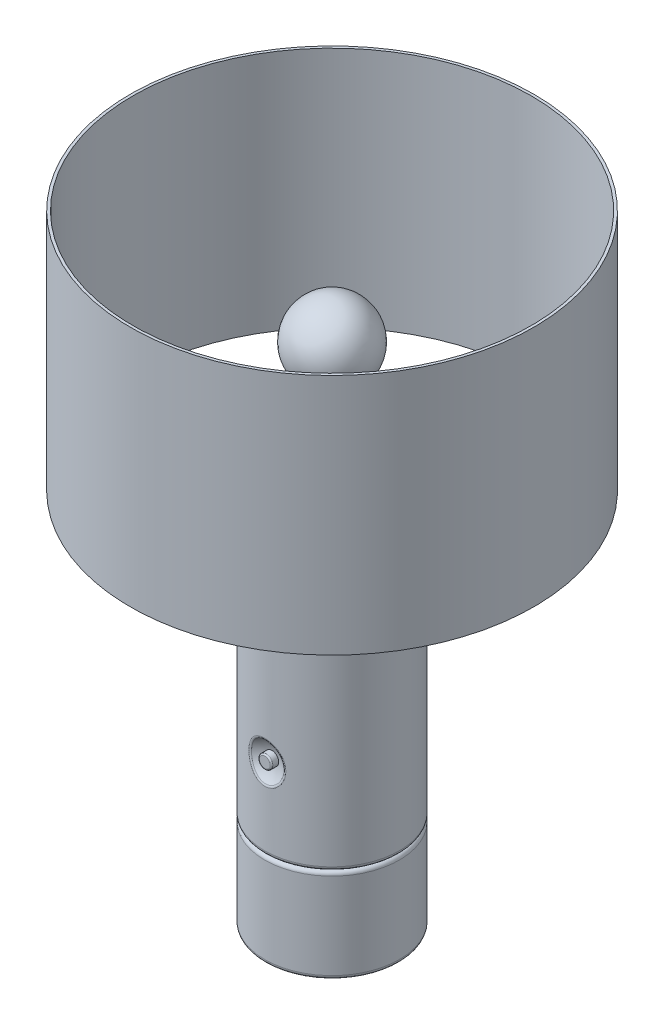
ISO-10303-21;
HEADER;
FILE_DESCRIPTION(('STEP AP214'),'2;1');
FILE_NAME('part.step','',(''),(''),'','','');
FILE_SCHEMA(('AUTOMOTIVE_DESIGN { 1 0 10303 214 1 1 1 1 }'));
ENDSEC;
DATA;
#1=APPLICATION_CONTEXT('core data for automotive mechanical design processes');
#2=APPLICATION_PROTOCOL_DEFINITION('international standard','automotive_design',2000,#1);
#3=PRODUCT_CONTEXT('',#1,'mechanical');
#4=PRODUCT('Part','Part','',(#3));
#5=PRODUCT_RELATED_PRODUCT_CATEGORY('part','',(#4));
#6=PRODUCT_DEFINITION_FORMATION('','',#4);
#7=PRODUCT_DEFINITION_CONTEXT('part definition',#1,'design');
#8=PRODUCT_DEFINITION('design','',#6,#7);
#9=PRODUCT_DEFINITION_SHAPE('','',#8);
#10=(LENGTH_UNIT() NAMED_UNIT(*) SI_UNIT(.MILLI.,.METRE.));
#11=(NAMED_UNIT(*) PLANE_ANGLE_UNIT() SI_UNIT($,.RADIAN.));
#12=(NAMED_UNIT(*) SI_UNIT($,.STERADIAN.) SOLID_ANGLE_UNIT());
#13=UNCERTAINTY_MEASURE_WITH_UNIT(LENGTH_MEASURE(1.E-05),#10,'distance_accuracy_value','');
#14=(GEOMETRIC_REPRESENTATION_CONTEXT(3) GLOBAL_UNCERTAINTY_ASSIGNED_CONTEXT((#13)) GLOBAL_UNIT_ASSIGNED_CONTEXT((#10,
#11,#12)) REPRESENTATION_CONTEXT('',''));
#15=CARTESIAN_POINT('',(0.,0.,0.));
#16=DIRECTION('',(0.,0.,1.));
#17=DIRECTION('',(1.,0.,0.));
#18=AXIS2_PLACEMENT_3D('',#15,#16,#17);
#19=CARTESIAN_POINT('',(-21.8607844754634,-162.442901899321,481.5));
#20=DIRECTION('',(0.,-1.,0.));
#21=DIRECTION('',(0.,0.,-1.));
#22=AXIS2_PLACEMENT_3D('',#19,#20,#21);
#23=CYLINDRICAL_SURFACE('',#22,50.);
#24=CARTESIAN_POINT('',(-21.8607844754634,-229.442901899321,481.5));
#25=DIRECTION('',(0.,1.,0.));
#26=DIRECTION('',(0.,0.,1.));
#27=AXIS2_PLACEMENT_3D('',#24,#25,#26);
#28=CIRCLE('',#27,50.);
#29=CARTESIAN_POINT('',(-21.8607844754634,-229.442901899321,531.5));
#30=VERTEX_POINT('',#29);
#31=EDGE_CURVE('P0_E21',#30,#30,#28,.T.);
#32=ORIENTED_EDGE('',*,*,#31,.T.);
#33=EDGE_LOOP('',(#32));
#34=FACE_BOUND('',#33,.T.);
#35=CARTESIAN_POINT('',(-21.8607844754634,-165.442901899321,481.5));
#36=DIRECTION('',(0.,1.,0.));
#37=DIRECTION('',(0.,0.,1.));
#38=AXIS2_PLACEMENT_3D('',#35,#36,#37);
#39=CIRCLE('',#38,50.);
#40=CARTESIAN_POINT('',(-21.8607844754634,-165.442901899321,531.5));
#41=VERTEX_POINT('',#40);
#42=EDGE_CURVE('P0_E28',#41,#41,#39,.F.);
#43=ORIENTED_EDGE('',*,*,#42,.T.);
#44=EDGE_LOOP('',(#43));
#45=FACE_BOUND('',#44,.T.);
#46=ADVANCED_FACE('P0_F13',(#34,#45),#23,.T.);
#47=CARTESIAN_POINT('',(-21.8607844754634,-162.442901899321,481.5));
#48=DIRECTION('',(0.,1.,0.));
#49=DIRECTION('',(0.,0.,1.));
#50=AXIS2_PLACEMENT_3D('',#47,#48,#49);
#51=PLANE('',#50);
#52=CARTESIAN_POINT('',(-21.8607844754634,-162.442901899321,481.5));
#53=DIRECTION('',(0.,1.,0.));
#54=DIRECTION('',(0.,0.,1.));
#55=AXIS2_PLACEMENT_3D('',#52,#53,#54);
#56=CIRCLE('',#55,47.);
#57=CARTESIAN_POINT('',(-21.8607844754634,-162.442901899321,528.5));
#58=VERTEX_POINT('',#57);
#59=EDGE_CURVE('P0_E33',#58,#58,#56,.T.);
#60=ORIENTED_EDGE('',*,*,#59,.T.);
#61=EDGE_LOOP('',(#60));
#62=FACE_BOUND('',#61,.T.);
#63=ADVANCED_FACE('P0_F39',(#62),#51,.T.);
#64=CARTESIAN_POINT('',(-21.8607844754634,-232.442901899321,481.5));
#65=DIRECTION('',(0.,1.,0.));
#66=DIRECTION('',(0.,0.,1.));
#67=AXIS2_PLACEMENT_3D('',#64,#65,#66);
#68=PLANE('',#67);
#69=CARTESIAN_POINT('',(-21.8607844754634,-232.442901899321,481.5));
#70=DIRECTION('',(0.,1.,0.));
#71=DIRECTION('',(0.,0.,1.));
#72=AXIS2_PLACEMENT_3D('',#69,#70,#71);
#73=CIRCLE('',#72,47.);
#74=CARTESIAN_POINT('',(-21.8607844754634,-232.442901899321,528.5));
#75=VERTEX_POINT('',#74);
#76=EDGE_CURVE('P0_E9',#75,#75,#73,.F.);
#77=ORIENTED_EDGE('',*,*,#76,.T.);
#78=EDGE_LOOP('',(#77));
#79=FACE_BOUND('',#78,.T.);
#80=ADVANCED_FACE('P0_F43',(#79),#68,.F.);
#81=CARTESIAN_POINT('',(-21.8607844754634,-165.442901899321,481.5));
#82=DIRECTION('',(0.,1.,0.));
#83=DIRECTION('',(0.,0.,1.));
#84=AXIS2_PLACEMENT_3D('',#81,#82,#83);
#85=TOROIDAL_SURFACE('',#84,47.,3.);
#86=ORIENTED_EDGE('',*,*,#42,.F.);
#87=EDGE_LOOP('',(#86));
#88=FACE_BOUND('',#87,.T.);
#89=ORIENTED_EDGE('',*,*,#59,.F.);
#90=EDGE_LOOP('',(#89));
#91=FACE_BOUND('',#90,.T.);
#92=ADVANCED_FACE('P0_F41',(#88,#91),#85,.T.);
#93=CARTESIAN_POINT('',(-21.8607844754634,-229.442901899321,481.5));
#94=DIRECTION('',(0.,1.,0.));
#95=DIRECTION('',(0.,0.,1.));
#96=AXIS2_PLACEMENT_3D('',#93,#94,#95);
#97=TOROIDAL_SURFACE('',#96,47.,3.);
#98=ORIENTED_EDGE('',*,*,#76,.F.);
#99=EDGE_LOOP('',(#98));
#100=FACE_BOUND('',#99,.T.);
#101=ORIENTED_EDGE('',*,*,#31,.F.);
#102=EDGE_LOOP('',(#101));
#103=FACE_BOUND('',#102,.T.);
#104=ADVANCED_FACE('P0_F15',(#100,#103),#97,.T.);
#105=CLOSED_SHELL('',(#46,#63,#80,#92,#104));
#106=MANIFOLD_SOLID_BREP('P0_B1',#105);
#107=CARTESIAN_POINT('',(-21.8607844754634,47.5570981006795,481.5));
#108=DIRECTION('',(0.,-1.,0.));
#109=DIRECTION('',(0.,0.,-1.));
#110=AXIS2_PLACEMENT_3D('',#107,#108,#109);
#111=CYLINDRICAL_SURFACE('',#110,5.);
#112=CARTESIAN_POINT('',(-21.8607844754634,47.5570981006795,481.5));
#113=DIRECTION('',(0.,1.,0.));
#114=DIRECTION('',(0.,0.,1.));
#115=AXIS2_PLACEMENT_3D('',#112,#113,#114);
#116=CIRCLE('',#115,5.);
#117=CARTESIAN_POINT('',(-21.8607844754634,47.5570981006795,486.5));
#118=VERTEX_POINT('',#117);
#119=EDGE_CURVE('P1_E10',#118,#118,#116,.T.);
#120=ORIENTED_EDGE('',*,*,#119,.F.);
#121=EDGE_LOOP('',(#120));
#122=FACE_BOUND('',#121,.T.);
#123=CARTESIAN_POINT('',(-21.8607844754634,17.5570981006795,481.5));
#124=DIRECTION('',(0.,1.,0.));
#125=DIRECTION('',(0.,0.,1.));
#126=AXIS2_PLACEMENT_3D('',#123,#124,#125);
#127=CIRCLE('',#126,5.);
#128=CARTESIAN_POINT('',(-21.8607844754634,17.5570981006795,486.5));
#129=VERTEX_POINT('',#128);
#130=EDGE_CURVE('P1_E17',#129,#129,#127,.T.);
#131=ORIENTED_EDGE('',*,*,#130,.T.);
#132=EDGE_LOOP('',(#131));
#133=FACE_BOUND('',#132,.T.);
#134=ADVANCED_FACE('P1_F14',(#122,#133),#111,.T.);
#135=CARTESIAN_POINT('',(-21.8607844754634,47.5570981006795,481.5));
#136=DIRECTION('',(0.,1.,0.));
#137=DIRECTION('',(0.,0.,1.));
#138=AXIS2_PLACEMENT_3D('',#135,#136,#137);
#139=PLANE('',#138);
#140=ORIENTED_EDGE('',*,*,#119,.T.);
#141=EDGE_LOOP('',(#140));
#142=FACE_BOUND('',#141,.T.);
#143=ADVANCED_FACE('P1_F32',(#142),#139,.T.);
#144=CARTESIAN_POINT('',(-21.8607844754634,17.5570981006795,481.5));
#145=DIRECTION('',(0.,1.,0.));
#146=DIRECTION('',(0.,0.,1.));
#147=AXIS2_PLACEMENT_3D('',#144,#145,#146);
#148=PLANE('',#147);
#149=ORIENTED_EDGE('',*,*,#130,.F.);
#150=EDGE_LOOP('',(#149));
#151=FACE_BOUND('',#150,.T.);
#152=ADVANCED_FACE('P1_F30',(#151),#148,.F.);
#153=CLOSED_SHELL('',(#134,#143,#152));
#154=MANIFOLD_SOLID_BREP('P1_B1',#153);
#155=CARTESIAN_POINT('',(-21.8607844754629,97.2468851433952,481.5));
#156=DIRECTION('',(0.,1.,0.));
#157=DIRECTION('',(0.999282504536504,0.,-0.037874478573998));
#158=AXIS2_PLACEMENT_3D('',#155,#156,#157);
#159=PLANE('',#158);
#160=CARTESIAN_POINT('',(-21.8607844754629,97.2468851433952,481.5));
#161=DIRECTION('',(0.,-1.,0.));
#162=DIRECTION('',(-0.999282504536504,0.,0.037874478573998));
#163=AXIS2_PLACEMENT_3D('',#160,#161,#162);
#164=CIRCLE('',#163,16.5);
#165=CARTESIAN_POINT('',(-38.3489458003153,97.2468851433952,482.124928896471));
#166=VERTEX_POINT('',#165);
#167=EDGE_CURVE('P2_E23',#166,#166,#164,.T.);
#168=ORIENTED_EDGE('',*,*,#167,.T.);
#169=EDGE_LOOP('',(#168));
#170=FACE_BOUND('',#169,.T.);
#171=ADVANCED_FACE('P2_F16',(#170),#159,.F.);
#172=CARTESIAN_POINT('',(-21.5297708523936,143.248777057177,481.487454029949));
#173=DIRECTION('',(0.037874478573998,0.,0.999282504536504));
#174=DIRECTION('',(-0.999282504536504,0.,0.037874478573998));
#175=AXIS2_PLACEMENT_3D('',#172,#173,#174);
#176=CIRCLE('',#175,29.);
#177=TRIMMED_CURVE('',#176,(PARAMETER_VALUE(-1.55937361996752)),
(PARAMETER_VALUE(1.55937361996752)),.T.,.PARAMETER.);
#178=CARTESIAN_POINT('',(-21.8607844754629,143.248777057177,481.5));
#179=DIRECTION('',(0.,-1.,0.));
#180=AXIS1_PLACEMENT('',#178,#179);
#181=SURFACE_OF_REVOLUTION('',#177,#180);
#182=CARTESIAN_POINT('',(-21.8607844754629,130.607277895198,481.5));
#183=DIRECTION('',(0.,-1.,0.));
#184=DIRECTION('',(-0.999282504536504,0.,0.037874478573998));
#185=AXIS2_PLACEMENT_3D('',#182,#183,#184);
#186=CIRCLE('',#185,25.7684134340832);
#187=CARTESIAN_POINT('',(-47.6107091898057,130.607277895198,482.475965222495));
#188=VERTEX_POINT('',#187);
#189=EDGE_CURVE('P2_E11',#188,#188,#186,.T.);
#190=ORIENTED_EDGE('',*,*,#189,.F.);
#191=EDGE_LOOP('',(#190));
#192=FACE_BOUND('',#191,.T.);
#193=CARTESIAN_POINT('',(-21.860784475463,172.246885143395,481.5));
#194=VERTEX_POINT('',#193);
#195=VERTEX_LOOP('',#194);
#196=FACE_BOUND('',#195,.T.);
#197=ADVANCED_FACE('P2_F26',(#192,#196),#181,.T.);
#198=CARTESIAN_POINT('',(-21.8607844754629,88.4689473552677,481.5));
#199=DIRECTION('',(0.,-1.,0.));
#200=DIRECTION('',(-0.999282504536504,0.,0.037874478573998));
#201=AXIS2_PLACEMENT_3D('',#198,#199,#200);
#202=TOROIDAL_SURFACE('',#201,112.767295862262,96.6666666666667);
#203=ORIENTED_EDGE('',*,*,#167,.F.);
#204=EDGE_LOOP('',(#203));
#205=FACE_BOUND('',#204,.T.);
#206=ORIENTED_EDGE('',*,*,#189,.T.);
#207=EDGE_LOOP('',(#206));
#208=FACE_BOUND('',#207,.T.);
#209=ADVANCED_FACE('P2_F28',(#205,#208),#202,.F.);
#210=CLOSED_SHELL('',(#171,#197,#209));
#211=MANIFOLD_SOLID_BREP('P2_B1',#210);
#212=CARTESIAN_POINT('',(-21.8607844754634,19.0570981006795,481.5));
#213=DIRECTION('',(0.,1.,0.));
#214=DIRECTION('',(0.,0.,1.));
#215=AXIS2_PLACEMENT_3D('',#212,#213,#214);
#216=PLANE('',#215);
#217=CARTESIAN_POINT('',(-21.8607844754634,19.0570981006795,481.5));
#218=DIRECTION('',(0.,1.,0.));
#219=DIRECTION('',(0.,0.,1.));
#220=AXIS2_PLACEMENT_3D('',#217,#218,#219);
#221=CIRCLE('',#220,15.);
#222=CARTESIAN_POINT('',(-21.8607844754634,19.0570981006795,496.5));
#223=VERTEX_POINT('',#222);
#224=EDGE_CURVE('P3_E10',#223,#223,#221,.T.);
#225=ORIENTED_EDGE('',*,*,#224,.T.);
#226=EDGE_LOOP('',(#225));
#227=FACE_BOUND('',#226,.T.);
#228=CARTESIAN_POINT('',(-21.8607844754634,19.0570981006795,481.5));
#229=DIRECTION('',(0.,1.,0.));
#230=DIRECTION('',(0.,0.,1.));
#231=AXIS2_PLACEMENT_3D('',#228,#229,#230);
#232=CIRCLE('',#231,5.);
#233=CARTESIAN_POINT('',(-21.8607844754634,19.0570981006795,486.5));
#234=VERTEX_POINT('',#233);
#235=EDGE_CURVE('P3_E30',#234,#234,#232,.T.);
#236=ORIENTED_EDGE('',*,*,#235,.F.);
#237=EDGE_LOOP('',(#236));
#238=FACE_BOUND('',#237,.T.);
#239=ADVANCED_FACE('P3_F14',(#227,#238),#216,.T.);
#240=CARTESIAN_POINT('',(-21.8607844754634,17.5570981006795,481.5));
#241=DIRECTION('',(0.,1.,0.));
#242=DIRECTION('',(0.,0.,1.));
#243=AXIS2_PLACEMENT_3D('',#240,#241,#242);
#244=PLANE('',#243);
#245=CARTESIAN_POINT('',(-21.8607844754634,17.5570981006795,481.5));
#246=DIRECTION('',(0.,1.,0.));
#247=DIRECTION('',(0.,0.,1.));
#248=AXIS2_PLACEMENT_3D('',#245,#246,#247);
#249=CIRCLE('',#248,15.);
#250=CARTESIAN_POINT('',(-21.8607844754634,17.5570981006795,496.5));
#251=VERTEX_POINT('',#250);
#252=EDGE_CURVE('P3_E18',#251,#251,#249,.T.);
#253=ORIENTED_EDGE('',*,*,#252,.F.);
#254=EDGE_LOOP('',(#253));
#255=FACE_BOUND('',#254,.T.);
#256=CARTESIAN_POINT('',(-21.8607844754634,17.5570981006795,481.5));
#257=DIRECTION('',(0.,1.,0.));
#258=DIRECTION('',(0.,0.,1.));
#259=AXIS2_PLACEMENT_3D('',#256,#257,#258);
#260=CIRCLE('',#259,5.);
#261=CARTESIAN_POINT('',(-21.8607844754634,17.5570981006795,486.5));
#262=VERTEX_POINT('',#261);
#263=EDGE_CURVE('P3_E32',#262,#262,#260,.T.);
#264=ORIENTED_EDGE('',*,*,#263,.T.);
#265=EDGE_LOOP('',(#264));
#266=FACE_BOUND('',#265,.T.);
#267=ADVANCED_FACE('P3_F42',(#255,#266),#244,.F.);
#268=CARTESIAN_POINT('',(-21.8607844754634,19.0570981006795,481.5));
#269=DIRECTION('',(0.,-1.,0.));
#270=DIRECTION('',(0.,0.,-1.));
#271=AXIS2_PLACEMENT_3D('',#268,#269,#270);
#272=CYLINDRICAL_SURFACE('',#271,15.);
#273=ORIENTED_EDGE('',*,*,#224,.F.);
#274=EDGE_LOOP('',(#273));
#275=FACE_BOUND('',#274,.T.);
#276=ORIENTED_EDGE('',*,*,#252,.T.);
#277=EDGE_LOOP('',(#276));
#278=FACE_BOUND('',#277,.T.);
#279=ADVANCED_FACE('P3_F16',(#275,#278),#272,.T.);
#280=CARTESIAN_POINT('',(-21.8607844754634,19.0570981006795,481.5));
#281=DIRECTION('',(0.,-1.,0.));
#282=DIRECTION('',(0.,0.,-1.));
#283=AXIS2_PLACEMENT_3D('',#280,#281,#282);
#284=CYLINDRICAL_SURFACE('',#283,5.);
#285=ORIENTED_EDGE('',*,*,#235,.T.);
#286=EDGE_LOOP('',(#285));
#287=FACE_BOUND('',#286,.T.);
#288=ORIENTED_EDGE('',*,*,#263,.F.);
#289=EDGE_LOOP('',(#288));
#290=FACE_BOUND('',#289,.T.);
#291=ADVANCED_FACE('P3_F38',(#287,#290),#284,.F.);
#292=CLOSED_SHELL('',(#239,#267,#279,#291));
#293=MANIFOLD_SOLID_BREP('P3_B1',#292);
#294=CARTESIAN_POINT('',(-21.8607844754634,17.5570981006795,481.5));
#295=DIRECTION('',(0.,-1.,0.));
#296=DIRECTION('',(0.,0.,-1.));
#297=AXIS2_PLACEMENT_3D('',#294,#295,#296);
#298=CYLINDRICAL_SURFACE('',#297,50.);
#299=CARTESIAN_POINT('',(-9.92062617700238,-100.628060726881,529.320390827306));
#300=CARTESIAN_POINT('',(-9.1463288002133,-100.561112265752,529.865614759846));
#301=CARTESIAN_POINT('',(-8.23858006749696,-100.455218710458,529.608580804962));
#302=CARTESIAN_POINT('',(-9.87314859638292,-101.067632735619,529.306937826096));
#303=CARTESIAN_POINT('',(-9.09595615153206,-101.01708125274,529.852446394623));
#304=CARTESIAN_POINT('',(-8.18441417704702,-100.936654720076,529.593232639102));
#305=CARTESIAN_POINT('',(-9.84302446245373,-101.509047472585,529.298339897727));
#306=CARTESIAN_POINT('',(-9.06401332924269,-101.474683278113,529.844036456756));
#307=CARTESIAN_POINT('',(-8.15004636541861,-101.420108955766,529.583423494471));
#308=CARTESIAN_POINT('',(-9.81736727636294,-102.39307305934,529.291020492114));
#309=CARTESIAN_POINT('',(-9.03679669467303,-102.391274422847,529.836874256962));
#310=CARTESIAN_POINT('',(-8.12077477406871,-102.388327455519,529.575072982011));
#311=CARTESIAN_POINT('',(-9.8218357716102,-102.83568396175,529.292299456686));
#312=CARTESIAN_POINT('',(-9.04153514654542,-102.850084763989,529.838125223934));
#313=CARTESIAN_POINT('',(-8.12587275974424,-102.873091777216,529.576532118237));
#314=CARTESIAN_POINT('',(-9.86540158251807,-103.719202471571,529.304720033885));
#315=CARTESIAN_POINT('',(-9.08774613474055,-103.766176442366,529.850278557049));
#316=CARTESIAN_POINT('',(-8.17557581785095,-103.840754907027,529.590702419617));
#317=CARTESIAN_POINT('',(-9.90451160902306,-104.160109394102,529.315865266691));
#318=CARTESIAN_POINT('',(-9.12921412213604,-104.223278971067,529.861179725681));
#319=CARTESIAN_POINT('',(-8.22019539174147,-104.323652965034,529.603417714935));
#320=CARTESIAN_POINT('',(-10.0174266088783,-105.037108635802,529.34772134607));
#321=CARTESIAN_POINT('',(-9.24899833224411,-105.132811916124,529.892359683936));
#322=CARTESIAN_POINT('',(-8.3490170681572,-105.284175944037,529.639761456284));
#323=CARTESIAN_POINT('',(-10.0912306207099,-105.473201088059,529.368431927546));
#324=CARTESIAN_POINT('',(-9.32726779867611,-105.585073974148,529.912626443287));
#325=CARTESIAN_POINT('',(-8.43321807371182,-105.761801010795,529.663389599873));
#326=CARTESIAN_POINT('',(-10.2766280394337,-106.351746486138,529.419688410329));
#327=CARTESIAN_POINT('',(-9.52398663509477,-106.496569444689,529.962823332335));
#328=CARTESIAN_POINT('',(-8.64473298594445,-106.724017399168,529.72186673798));
#329=CARTESIAN_POINT('',(-10.3893832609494,-106.793937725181,529.450535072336));
#330=CARTESIAN_POINT('',(-9.64359788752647,-106.955395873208,529.993030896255));
#331=CARTESIAN_POINT('',(-8.77337237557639,-107.20832208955,529.757058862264));
#332=CARTESIAN_POINT('',(-10.6520671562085,-107.666261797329,529.520900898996));
#333=CARTESIAN_POINT('',(-9.92242324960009,-107.860997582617,530.062002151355));
#334=CARTESIAN_POINT('',(-9.07306134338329,-108.163724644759,529.837337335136));
#335=CARTESIAN_POINT('',(-10.801981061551,-108.096399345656,529.56041661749));
#336=CARTESIAN_POINT('',(-10.0815198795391,-108.307640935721,530.100738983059));
#337=CARTESIAN_POINT('',(-9.24409407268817,-108.634827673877,529.882419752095));
#338=CARTESIAN_POINT('',(-11.1391569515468,-108.941288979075,529.646913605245));
#339=CARTESIAN_POINT('',(-10.4395690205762,-109.185429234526,530.185613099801));
#340=CARTESIAN_POINT('',(-9.62876894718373,-109.560182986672,529.981101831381));
#341=CARTESIAN_POINT('',(-11.3264374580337,-109.356033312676,529.693898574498));
#342=CARTESIAN_POINT('',(-10.6384230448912,-109.616467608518,530.231729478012));
#343=CARTESIAN_POINT('',(-9.84243222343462,-110.01442678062,530.034705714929));
#344=CARTESIAN_POINT('',(-11.7382359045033,-110.165875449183,529.793758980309));
#345=CARTESIAN_POINT('',(-11.0759352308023,-110.458593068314,530.329840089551));
#346=CARTESIAN_POINT('',(-10.3122419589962,-110.901396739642,530.148633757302));
#347=CARTESIAN_POINT('',(-11.9627501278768,-110.560975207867,529.846633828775));
#348=CARTESIAN_POINT('',(-11.3144635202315,-110.869626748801,530.381811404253));
#349=CARTESIAN_POINT('',(-10.5683841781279,-111.334125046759,530.20895724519));
#350=CARTESIAN_POINT('',(-12.4343282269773,-111.304515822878,529.953140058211));
#351=CARTESIAN_POINT('',(-11.8157968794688,-111.643613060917,530.486603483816));
#352=CARTESIAN_POINT('',(-11.1063949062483,-112.148479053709,530.33046732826));
#353=CARTESIAN_POINT('',(-12.6792700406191,-111.654334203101,530.006541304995));
#354=CARTESIAN_POINT('',(-12.0761944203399,-112.007919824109,530.539171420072));
#355=CARTESIAN_POINT('',(-11.3858424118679,-112.531613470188,530.391391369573));
#356=CARTESIAN_POINT('',(-13.2012718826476,-112.328819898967,530.115062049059));
#357=CARTESIAN_POINT('',(-12.6314024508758,-112.710661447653,530.646086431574));
#358=CARTESIAN_POINT('',(-11.9813802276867,-113.270335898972,530.515199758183));
#359=CARTESIAN_POINT('',(-13.4783256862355,-112.653492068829,530.170181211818));
#360=CARTESIAN_POINT('',(-12.9261180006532,-113.049133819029,530.700426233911));
#361=CARTESIAN_POINT('',(-12.297463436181,-113.625929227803,530.578083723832));
#362=CARTESIAN_POINT('',(-14.0630921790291,-113.273049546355,530.28000982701));
#363=CARTESIAN_POINT('',(-13.54842659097,-113.695278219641,530.808780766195));
#364=CARTESIAN_POINT('',(-12.9646077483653,-114.304492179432,530.703384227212));
#365=CARTESIAN_POINT('',(-14.3707531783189,-113.567983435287,530.334719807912));
#366=CARTESIAN_POINT('',(-13.8758993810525,-114.003068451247,530.86279720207));
#367=CARTESIAN_POINT('',(-13.3156098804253,-114.627515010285,530.765801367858));
#368=CARTESIAN_POINT('',(-15.0154622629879,-114.12421883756,530.441595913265));
#369=CARTESIAN_POINT('',(-14.5623656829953,-114.583724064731,530.968381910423));
#370=CARTESIAN_POINT('',(-14.051141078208,-115.236725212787,530.887733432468));
#371=CARTESIAN_POINT('',(-15.3524983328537,-114.385533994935,530.49376306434));
#372=CARTESIAN_POINT('',(-14.9213169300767,-114.856703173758,531.019961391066));
#373=CARTESIAN_POINT('',(-14.4356564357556,-115.522927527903,530.947249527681));
#374=CARTESIAN_POINT('',(-15.9548522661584,-114.801894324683,530.579246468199));
#375=CARTESIAN_POINT('',(-15.5631683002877,-115.291840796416,531.10454056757));
#376=CARTESIAN_POINT('',(-15.1228657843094,-115.978941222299,531.044775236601));
#377=CARTESIAN_POINT('',(-16.2136753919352,-114.966155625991,530.613737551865));
#378=CARTESIAN_POINT('',(-15.8389439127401,-115.46354452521,531.138677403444));
#379=CARTESIAN_POINT('',(-15.4181501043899,-116.158846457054,531.08412518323));
#380=CARTESIAN_POINT('',(-16.7440414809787,-115.273385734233,530.679362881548));
#381=CARTESIAN_POINT('',(-16.4041237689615,-115.784732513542,531.203645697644));
#382=CARTESIAN_POINT('',(-16.023230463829,-116.495336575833,531.158995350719));
#383=CARTESIAN_POINT('',(-17.0155814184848,-115.41635957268,530.71049792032));
#384=CARTESIAN_POINT('',(-16.693543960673,-115.934269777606,531.234486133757));
#385=CARTESIAN_POINT('',(-16.3330230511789,-116.651926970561,531.19451647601));
#386=CARTESIAN_POINT('',(-17.5698227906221,-115.679407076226,530.768582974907));
#387=CARTESIAN_POINT('',(-17.2843355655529,-116.209408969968,531.292031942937));
#388=CARTESIAN_POINT('',(-16.9653420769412,-116.940026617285,531.260784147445));
#389=CARTESIAN_POINT('',(-17.8525188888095,-115.79949153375,530.795534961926));
#390=CARTESIAN_POINT('',(-17.5857345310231,-116.335069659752,531.318748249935));
#391=CARTESIAN_POINT('',(-17.2878624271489,-117.071547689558,531.291532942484));
#392=CARTESIAN_POINT('',(-18.4274687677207,-116.015422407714,530.844524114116));
#393=CARTESIAN_POINT('',(-18.1987511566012,-116.561025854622,531.367313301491));
#394=CARTESIAN_POINT('',(-17.9438072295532,-117.308043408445,531.347423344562));
#395=CARTESIAN_POINT('',(-18.7197229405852,-116.111267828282,530.866561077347));
#396=CARTESIAN_POINT('',(-18.5104164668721,-116.661364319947,531.389170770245));
#397=CARTESIAN_POINT('',(-18.2772321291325,-117.413016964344,531.372564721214));
#398=CARTESIAN_POINT('',(-19.3129321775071,-116.277814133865,530.905151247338));
#399=CARTESIAN_POINT('',(-19.1430263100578,-116.835704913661,531.427446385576));
#400=CARTESIAN_POINT('',(-18.9540085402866,-117.595424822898,531.416591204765));
#401=CARTESIAN_POINT('',(-19.61391705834,-116.348414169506,530.921682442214));
#402=CARTESIAN_POINT('',(-19.4640638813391,-116.909639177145,531.44385074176));
#403=CARTESIAN_POINT('',(-19.2973940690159,-117.672748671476,531.435451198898));
#404=CARTESIAN_POINT('',(-20.221195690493,-116.462975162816,530.948635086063));
#405=CARTESIAN_POINT('',(-20.1117743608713,-117.02959355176,531.470593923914));
#406=CARTESIAN_POINT('',(-19.9902218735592,-117.798220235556,531.466200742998));
#407=CARTESIAN_POINT('',(-20.5274894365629,-116.506936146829,530.959056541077));
#408=CARTESIAN_POINT('',(-20.4385180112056,-117.075641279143,531.480938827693));
#409=CARTESIAN_POINT('',(-20.3396641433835,-117.846367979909,531.478090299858));
#410=CARTESIAN_POINT('',(-21.142880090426,-116.567591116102,530.973461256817));
#411=CARTESIAN_POINT('',(-21.0949414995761,-117.139162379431,531.495235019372));
#412=CARTESIAN_POINT('',(-21.0417467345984,-117.912799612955,531.494524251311));
#413=CARTESIAN_POINT('',(-21.4519766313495,-116.584288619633,530.977445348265));
#414=CARTESIAN_POINT('',(-21.4246985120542,-117.156654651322,531.499190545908));
#415=CARTESIAN_POINT('',(-21.3943866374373,-117.93108735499,531.499069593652));
#416=CARTESIAN_POINT('',(-22.07043787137,-116.590183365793,530.978850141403));
#417=CARTESIAN_POINT('',(-22.0844205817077,-117.162828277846,531.500584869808));
#418=CARTESIAN_POINT('',(-22.0999723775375,-117.937543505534,531.50067228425));
#419=CARTESIAN_POINT('',(-22.3798025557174,-116.579382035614,530.976271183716));
#420=CARTESIAN_POINT('',(-22.414465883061,-117.15151262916,531.498024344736));
#421=CARTESIAN_POINT('',(-22.4529181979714,-117.925713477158,531.497730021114));
#422=CARTESIAN_POINT('',(-22.9751414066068,-116.532118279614,530.965032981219));
#423=CARTESIAN_POINT('',(-23.0495038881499,-117.102014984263,531.486870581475));
#424=CARTESIAN_POINT('',(-23.1321242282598,-117.873948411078,531.484908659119));
#425=CARTESIAN_POINT('',(-23.2612689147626,-116.497460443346,530.956801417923));
#426=CARTESIAN_POINT('',(-23.3547370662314,-117.065711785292,531.478699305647));
#427=CARTESIAN_POINT('',(-23.458559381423,-117.835989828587,531.475517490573));
#428=CARTESIAN_POINT('',(-23.8296157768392,-116.40483642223,530.934938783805));
#429=CARTESIAN_POINT('',(-23.9609432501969,-116.968721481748,531.457004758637));
#430=CARTESIAN_POINT('',(-24.1069709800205,-117.73454447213,531.450575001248));
#431=CARTESIAN_POINT('',(-24.1118337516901,-116.346862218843,530.921305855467));
#432=CARTESIAN_POINT('',(-24.2619737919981,-116.908006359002,531.443475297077));
#433=CARTESIAN_POINT('',(-24.4289458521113,-117.671048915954,531.435021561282));
#434=CARTESIAN_POINT('',(-24.6702386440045,-116.208330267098,530.889012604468));
#435=CARTESIAN_POINT('',(-24.8575029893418,-116.762975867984,531.411440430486));
#436=CARTESIAN_POINT('',(-25.0660149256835,-117.519323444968,531.398179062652));
#437=CARTESIAN_POINT('',(-24.9464280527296,-116.12778204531,530.870354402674));
#438=CARTESIAN_POINT('',(-25.1520564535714,-116.678642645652,531.392931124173));
#439=CARTESIAN_POINT('',(-25.3811119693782,-117.431103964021,531.376892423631));
#440=CARTESIAN_POINT('',(-25.4912732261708,-115.944983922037,530.828485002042));
#441=CARTESIAN_POINT('',(-25.7330271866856,-116.487326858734,531.351414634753));
#442=CARTESIAN_POINT('',(-26.0027111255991,-117.230896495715,531.329124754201));
#443=CARTESIAN_POINT('',(-25.7599260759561,-115.842725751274,530.80527206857));
#444=CARTESIAN_POINT('',(-26.0194843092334,-116.380301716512,531.328398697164));
#445=CARTESIAN_POINT('',(-26.3092099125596,-117.118899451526,531.302641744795));
#446=CARTESIAN_POINT('',(-26.2926312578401,-115.615673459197,530.754438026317));
#447=CARTESIAN_POINT('',(-26.5873941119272,-116.142757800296,531.278020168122));
#448=CARTESIAN_POINT('',(-26.9169588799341,-116.870223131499,531.244646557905));
#449=CARTESIAN_POINT('',(-26.5565243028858,-115.490521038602,530.726747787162));
#450=CARTESIAN_POINT('',(-26.8687048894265,-116.011828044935,531.250582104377));
#451=CARTESIAN_POINT('',(-27.2180273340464,-116.733151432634,531.213055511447));
#452=CARTESIAN_POINT('',(-27.0734937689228,-115.220202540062,530.667933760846));
#453=CARTESIAN_POINT('',(-27.4196968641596,-115.729148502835,531.192333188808));
#454=CARTESIAN_POINT('',(-27.8078238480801,-116.437088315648,531.145956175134));
#455=CARTESIAN_POINT('',(-27.3265663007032,-115.075029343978,530.636808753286));
#456=CARTESIAN_POINT('',(-27.6893967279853,-115.577350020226,531.161513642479));
#457=CARTESIAN_POINT('',(-28.0965474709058,-116.278089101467,531.110446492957));
#458=CARTESIAN_POINT('',(-28.0676533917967,-114.611555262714,530.539366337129));
#459=CARTESIAN_POINT('',(-28.4794970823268,-115.092642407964,531.065022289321));
#460=CARTESIAN_POINT('',(-28.94203373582,-115.770474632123,530.999277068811));
#461=CARTESIAN_POINT('',(-28.5378696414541,-114.265156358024,530.468948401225));
#462=CARTESIAN_POINT('',(-28.9803591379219,-114.730614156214,530.995362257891));
#463=CARTESIAN_POINT('',(-29.4784907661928,-115.39108535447,530.918939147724));
#464=CARTESIAN_POINT('',(-29.4688062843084,-113.470379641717,530.315695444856));
#465=CARTESIAN_POINT('',(-29.9717608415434,-113.90079524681,530.843930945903));
#466=CARTESIAN_POINT('',(-30.5405712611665,-114.520615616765,530.744096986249));
#467=CARTESIAN_POINT('',(-29.9235552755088,-113.015171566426,530.232328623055));
#468=CARTESIAN_POINT('',(-30.4556729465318,-113.425749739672,530.761640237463));
#469=CARTESIAN_POINT('',(-31.0593821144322,-114.02205439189,530.64898602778));
#470=CARTESIAN_POINT('',(-30.7613163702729,-112.042828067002,530.067076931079));
#471=CARTESIAN_POINT('',(-31.3470006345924,-112.412128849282,530.598708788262));
#472=CARTESIAN_POINT('',(-32.0151611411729,-112.957106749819,530.460454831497));
#473=CARTESIAN_POINT('',(-31.1442985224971,-111.52566693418,529.985192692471));
#474=CARTESIAN_POINT('',(-31.7541212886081,-111.873348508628,530.518077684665));
#475=CARTESIAN_POINT('',(-32.4520951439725,-112.390692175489,530.367035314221));
#476=CARTESIAN_POINT('',(-31.8860677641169,-110.364852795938,529.818141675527));
#477=CARTESIAN_POINT('',(-32.5428363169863,-110.66478132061,530.353681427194));
#478=CARTESIAN_POINT('',(-33.2983596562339,-111.119324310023,530.176451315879));
#479=CARTESIAN_POINT('',(-32.2334077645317,-109.713712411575,529.73420340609));
#480=CARTESIAN_POINT('',(-32.911610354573,-109.987628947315,530.271246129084));
#481=CARTESIAN_POINT('',(-33.6946304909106,-110.406170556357,530.080688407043));
#482=CARTESIAN_POINT('',(-32.8303020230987,-108.365792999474,529.584358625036));
#483=CARTESIAN_POINT('',(-33.5455928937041,-108.58670947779,530.124134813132));
#484=CARTESIAN_POINT('',(-34.3756110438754,-108.929877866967,529.909734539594));
#485=CARTESIAN_POINT('',(-33.0797594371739,-107.668969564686,529.518469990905));
#486=CARTESIAN_POINT('',(-33.8101724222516,-107.863251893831,530.059580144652));
#487=CARTESIAN_POINT('',(-34.6602102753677,-108.166690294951,529.834563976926));
#488=CARTESIAN_POINT('',(-33.5079764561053,-106.149717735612,529.402914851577));
#489=CARTESIAN_POINT('',(-34.2647417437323,-106.286039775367,529.946317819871));
#490=CARTESIAN_POINT('',(-35.1487515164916,-106.502747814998,529.702730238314));
#491=CARTESIAN_POINT('',(-33.672612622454,-105.323047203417,529.356647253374));
#492=CARTESIAN_POINT('',(-34.4391627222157,-105.429000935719,529.901086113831));
#493=CARTESIAN_POINT('',(-35.3365804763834,-105.597346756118,529.649944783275));
#494=CARTESIAN_POINT('',(-33.8761644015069,-103.654234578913,529.29915430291));
#495=CARTESIAN_POINT('',(-34.6551024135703,-103.698301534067,529.844811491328));
#496=CARTESIAN_POINT('',(-35.5688072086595,-103.769599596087,529.584352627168));
#497=CARTESIAN_POINT('',(-33.9152729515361,-102.812118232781,529.287875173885));
#498=CARTESIAN_POINT('',(-34.6965260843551,-102.825839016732,529.833793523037));
#499=CARTESIAN_POINT('',(-35.613425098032,-102.84728169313,529.571484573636));
#500=CARTESIAN_POINT('',(-33.8833778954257,-101.662334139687,529.296956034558));
#501=CARTESIAN_POINT('',(-34.6626794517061,-101.633598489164,529.842683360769));
#502=CARTESIAN_POINT('',(-35.5770368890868,-101.587994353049,529.58184468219));
#503=CARTESIAN_POINT('',(-33.8662353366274,-101.352308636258,529.301856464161));
#504=CARTESIAN_POINT('',(-34.6445034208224,-101.312174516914,529.847476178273));
#505=CARTESIAN_POINT('',(-35.5574794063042,-101.248442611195,529.587435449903));
#506=CARTESIAN_POINT('',(-33.8148948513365,-100.733793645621,529.316446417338));
#507=CARTESIAN_POINT('',(-34.5900447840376,-100.670813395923,529.861753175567));
#508=CARTESIAN_POINT('',(-35.498906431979,-100.571021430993,529.604080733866));
#509=CARTESIAN_POINT('',(-33.7806976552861,-100.425304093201,529.326135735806));
#510=CARTESIAN_POINT('',(-34.5537733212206,-100.350936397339,529.871234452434));
#511=CARTESIAN_POINT('',(-35.4598917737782,-100.233151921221,529.615135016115));
#512=CARTESIAN_POINT('',(-33.6270965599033,-99.3214114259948,529.369401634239));
#513=CARTESIAN_POINT('',(-34.3908950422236,-99.206468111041,529.913566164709));
#514=CARTESIAN_POINT('',(-35.2846524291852,-99.0241266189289,529.664495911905));
#515=CARTESIAN_POINT('',(-33.4587160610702,-98.532716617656,529.416449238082));
#516=CARTESIAN_POINT('',(-34.2124660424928,-98.3886831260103,529.959574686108));
#517=CARTESIAN_POINT('',(-35.0925516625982,-98.1603180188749,529.718171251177));
#518=CARTESIAN_POINT('',(-33.0057352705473,-96.9897586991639,529.538148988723));
#519=CARTESIAN_POINT('',(-33.7316519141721,-96.7869318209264,530.078860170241));
#520=CARTESIAN_POINT('',(-34.5757581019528,-96.4704117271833,529.857015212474));
#521=CARTESIAN_POINT('',(-32.7209211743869,-96.2355617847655,529.612851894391));
#522=CARTESIAN_POINT('',(-33.4295908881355,-96.0038013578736,530.152058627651));
#523=CARTESIAN_POINT('',(-34.2508213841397,-95.6443865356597,529.942241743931));
#524=CARTESIAN_POINT('',(-32.2062043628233,-95.1462159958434,529.740070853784));
#525=CARTESIAN_POINT('',(-32.8823733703,-94.8704562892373,530.277097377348));
#526=CARTESIAN_POINT('',(-33.6635948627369,-94.4512935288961,530.087382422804));
#527=CARTESIAN_POINT('',(-32.0195182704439,-94.7893197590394,529.785125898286));
#528=CARTESIAN_POINT('',(-32.6840662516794,-94.499298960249,530.321361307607));
#529=CARTESIAN_POINT('',(-33.4506097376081,-94.0604071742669,530.138784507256));
#530=CARTESIAN_POINT('',(-31.6170457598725,-94.0929105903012,529.879028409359));
#531=CARTESIAN_POINT('',(-32.2563296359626,-93.7747247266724,530.413690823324));
#532=CARTESIAN_POINT('',(-32.991439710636,-93.297673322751,530.245915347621));
#533=CARTESIAN_POINT('',(-31.4012710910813,-93.7533907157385,529.927874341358));
#534=CARTESIAN_POINT('',(-32.0269998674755,-93.4213206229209,530.461741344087));
#535=CARTESIAN_POINT('',(-32.7452682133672,-92.9258182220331,530.301642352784));
#536=CARTESIAN_POINT('',(-30.9411338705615,-93.0951162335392,530.027906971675));
#537=CARTESIAN_POINT('',(-31.5377305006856,-92.7358146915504,530.560223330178));
#538=CARTESIAN_POINT('',(-32.2203100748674,-92.2048509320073,530.415766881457));
#539=CARTESIAN_POINT('',(-30.696796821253,-92.7763434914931,530.079091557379));
#540=CARTESIAN_POINT('',(-31.277898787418,-92.4036839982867,530.610643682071));
#541=CARTESIAN_POINT('',(-31.9415525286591,-91.8557188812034,530.474161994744));
#542=CARTESIAN_POINT('',(-30.1800079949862,-92.1626091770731,530.182230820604));
#543=CARTESIAN_POINT('',(-30.728105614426,-91.7639707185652,530.712317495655));
#544=CARTESIAN_POINT('',(-31.351962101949,-91.1835336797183,530.59183079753));
#545=CARTESIAN_POINT('',(-29.9075624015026,-91.8676423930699,530.234185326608));
#546=CARTESIAN_POINT('',(-30.4382169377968,-91.4563423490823,530.76356787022));
#547=CARTESIAN_POINT('',(-31.0411362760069,-90.8604748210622,530.651104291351));
#548=CARTESIAN_POINT('',(-29.3892975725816,-91.3578866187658,530.327433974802));
#549=CARTESIAN_POINT('',(-29.8864702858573,-90.9244273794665,530.855627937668));
#550=CARTESIAN_POINT('',(-30.4498619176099,-90.3021708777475,530.757489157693));
#551=CARTESIAN_POINT('',(-29.1480775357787,-91.1384396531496,530.368898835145));
#552=CARTESIAN_POINT('',(-29.6296706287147,-90.6953734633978,530.896580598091));
#553=CARTESIAN_POINT('',(-30.1746604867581,-90.0618242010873,530.804795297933));
#554=CARTESIAN_POINT('',(-28.648585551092,-90.7195812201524,530.450160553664));
#555=CARTESIAN_POINT('',(-29.0977915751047,-90.2580722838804,530.976874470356));
#556=CARTESIAN_POINT('',(-29.6048035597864,-89.6030744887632,530.89750459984));
#557=CARTESIAN_POINT('',(-28.3903166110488,-90.5201662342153,530.48995770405));
#558=CARTESIAN_POINT('',(-28.8227259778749,-90.0497750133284,531.016221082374));
#559=CARTESIAN_POINT('',(-29.3101514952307,-89.3846675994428,530.942908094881));
#560=CARTESIAN_POINT('',(-27.8577668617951,-90.1433509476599,530.566854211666));
#561=CARTESIAN_POINT('',(-28.2554305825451,-89.6561021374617,531.092275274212));
#562=CARTESIAN_POINT('',(-28.7025798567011,-88.9719651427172,531.030637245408));
#563=CARTESIAN_POINT('',(-27.583485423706,-89.9659515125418,530.603953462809));
#564=CARTESIAN_POINT('',(-27.963195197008,-89.4706735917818,531.128990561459));
#565=CARTESIAN_POINT('',(-28.3896595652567,-88.7776705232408,531.072962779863));
#566=CARTESIAN_POINT('',(-27.0204546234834,-89.6352499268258,530.674399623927));
#567=CARTESIAN_POINT('',(-27.3632207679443,-89.1249623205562,531.198727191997));
#568=CARTESIAN_POINT('',(-27.7473129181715,-88.4154735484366,531.153332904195));
#569=CARTESIAN_POINT('',(-26.7317124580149,-89.481935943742,530.707748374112));
#570=CARTESIAN_POINT('',(-27.0554675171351,-88.9646096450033,531.231760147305));
#571=CARTESIAN_POINT('',(-27.4178947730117,-88.2475582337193,531.19137959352));
#572=CARTESIAN_POINT('',(-26.139547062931,-89.2003300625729,530.769913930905));
#573=CARTESIAN_POINT('',(-26.4242547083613,-88.6700613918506,531.293347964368));
#574=CARTESIAN_POINT('',(-26.7423092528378,-87.9391327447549,531.262302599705));
#575=CARTESIAN_POINT('',(-25.8360436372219,-89.0721998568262,530.798701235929));
#576=CARTESIAN_POINT('',(-26.1006661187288,-88.5359753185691,531.321884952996));
#577=CARTESIAN_POINT('',(-26.3960503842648,-87.7987996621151,531.295145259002));
#578=CARTESIAN_POINT('',(-25.2183299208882,-88.8439721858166,530.85055810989));
#579=CARTESIAN_POINT('',(-25.442045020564,-88.2971454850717,531.373294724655));
#580=CARTESIAN_POINT('',(-25.6913174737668,-87.5488360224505,531.354307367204));
#581=CARTESIAN_POINT('',(-24.9041244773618,-88.7438622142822,530.873630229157));
#582=CARTESIAN_POINT('',(-25.1069586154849,-88.1923348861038,531.396180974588));
#583=CARTESIAN_POINT('',(-25.3328489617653,-87.4391917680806,531.38062972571));
#584=CARTESIAN_POINT('',(-24.2674575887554,-88.5730972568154,530.913292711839));
#585=CARTESIAN_POINT('',(-24.4279881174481,-88.0135705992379,531.435522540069));
#586=CARTESIAN_POINT('',(-24.6064928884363,-87.2521634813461,531.425879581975));
#587=CARTESIAN_POINT('',(-23.9449977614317,-88.5024365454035,530.929884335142));
#588=CARTESIAN_POINT('',(-24.0840303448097,-87.9395666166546,531.45198858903));
#589=CARTESIAN_POINT('',(-24.2386071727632,-87.1747731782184,531.444808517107));
#590=CARTESIAN_POINT('',(-23.2946006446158,-88.3916574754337,530.956008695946));
#591=CARTESIAN_POINT('',(-23.3903145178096,-87.8235675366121,531.477911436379));
#592=CARTESIAN_POINT('',(-23.4965866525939,-87.053443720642,531.474613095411));
#593=CARTESIAN_POINT('',(-22.9666639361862,-88.3515358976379,530.965542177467));
#594=CARTESIAN_POINT('',(-23.0404689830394,-87.781538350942,531.487375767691));
#595=CARTESIAN_POINT('',(-23.1224525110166,-87.0095010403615,531.485489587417));
#596=CARTESIAN_POINT('',(-22.3421389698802,-88.3049896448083,530.97661374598));
#597=CARTESIAN_POINT('',(-22.3742847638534,-87.7327904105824,531.498364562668));
#598=CARTESIAN_POINT('',(-22.4099488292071,-86.9585218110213,531.498120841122));
#599=CARTESIAN_POINT('',(-22.0457857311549,-88.2955305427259,530.978871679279));
#600=CARTESIAN_POINT('',(-22.0581236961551,-87.7228813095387,531.500606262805));
#601=CARTESIAN_POINT('',(-22.0718474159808,-86.9481618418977,531.500696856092));
#602=CARTESIAN_POINT('',(-21.4533677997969,-88.3018397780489,530.977367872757));
#603=CARTESIAN_POINT('',(-21.4261823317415,-87.729489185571,531.499113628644));
#604=CARTESIAN_POINT('',(-21.3959737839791,-86.9550719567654,531.498981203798));
#605=CARTESIAN_POINT('',(-21.1573030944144,-88.3176069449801,530.973606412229));
#606=CARTESIAN_POINT('',(-21.1103315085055,-87.7460064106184,531.495379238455));
#607=CARTESIAN_POINT('',(-21.0582015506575,-86.9723407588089,531.494689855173));
#608=CARTESIAN_POINT('',(-20.5677803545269,-88.3741529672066,530.960175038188));
#609=CARTESIAN_POINT('',(-20.4814995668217,-87.8052245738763,531.482048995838));
#610=CARTESIAN_POINT('',(-20.3856309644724,-87.0342721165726,531.479366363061));
#611=CARTESIAN_POINT('',(-20.2743217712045,-88.4149264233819,530.950506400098));
#612=CARTESIAN_POINT('',(-20.1684495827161,-87.8479328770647,531.472451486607));
#613=CARTESIAN_POINT('',(-20.0508319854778,-87.0789287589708,531.468335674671));
#614=CARTESIAN_POINT('',(-19.6921080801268,-88.5209491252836,530.925540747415));
#615=CARTESIAN_POINT('',(-19.5474675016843,-87.9589487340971,531.447679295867));
#616=CARTESIAN_POINT('',(-19.3866000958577,-87.1950488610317,531.439853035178));
#617=CARTESIAN_POINT('',(-19.403353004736,-88.5861985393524,530.910243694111));
#618=CARTESIAN_POINT('',(-19.2394727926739,-88.0272799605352,531.432499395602));
#619=CARTESIAN_POINT('',(-19.057167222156,-87.2665125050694,531.42240103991));
#620=CARTESIAN_POINT('',(-18.8410841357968,-88.7380519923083,530.874985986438));
#621=CARTESIAN_POINT('',(-18.6398515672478,-88.1862443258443,531.397527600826));
#622=CARTESIAN_POINT('',(-18.4156898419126,-87.4328281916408,531.382176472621));
#623=CARTESIAN_POINT('',(-18.5673725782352,-88.8239617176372,530.855177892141));
#624=CARTESIAN_POINT('',(-18.3479547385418,-88.2761834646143,531.37787992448));
#625=CARTESIAN_POINT('',(-18.1034197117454,-87.5269197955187,531.359577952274));
#626=CARTESIAN_POINT('',(-18.0278576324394,-89.0171109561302,530.811169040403));
#627=CARTESIAN_POINT('',(-17.7726961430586,-88.4783148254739,531.334247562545));
#628=CARTESIAN_POINT('',(-17.4879016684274,-87.7384641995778,531.309369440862));
#629=CARTESIAN_POINT('',(-17.7620568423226,-89.1243573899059,530.786966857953));
#630=CARTESIAN_POINT('',(-17.4892969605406,-88.5905491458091,531.31025432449));
#631=CARTESIAN_POINT('',(-17.1846567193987,-87.8559245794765,531.281757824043));
#632=CARTESIAN_POINT('',(-17.2399841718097,-89.3590042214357,530.734772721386));
#633=CARTESIAN_POINT('',(-16.9327591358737,-88.8360108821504,531.258536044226));
#634=CARTESIAN_POINT('',(-16.5890380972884,-88.1129187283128,531.222210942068));
#635=CARTESIAN_POINT('',(-16.9837100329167,-89.486399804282,530.706781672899));
#636=CARTESIAN_POINT('',(-16.6595880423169,-88.969271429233,531.230804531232));
#637=CARTESIAN_POINT('',(-16.2966618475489,-88.2524472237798,531.190276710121));
#638=CARTESIAN_POINT('',(-16.4817826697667,-89.760162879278,530.647646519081));
#639=CARTESIAN_POINT('',(-16.1246630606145,-89.2555205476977,531.172247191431));
#640=CARTESIAN_POINT('',(-15.7240264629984,-88.5522829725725,531.122811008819));
#641=CARTESIAN_POINT('',(-16.2361335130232,-89.9065375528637,530.616501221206));
#642=CARTESIAN_POINT('',(-15.8628943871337,-89.4085555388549,531.141413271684));
#643=CARTESIAN_POINT('',(-15.4437719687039,-88.7125980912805,531.087278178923));
#644=CARTESIAN_POINT('',(-15.7398620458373,-90.2277432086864,530.549491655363));
#645=CARTESIAN_POINT('',(-15.3341294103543,-89.7442501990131,531.075105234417));
#646=CARTESIAN_POINT('',(-14.8775892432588,-89.0643947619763,531.010828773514));
#647=CARTESIAN_POINT('',(-15.4900863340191,-90.403846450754,530.513449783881));
#648=CARTESIAN_POINT('',(-15.0680537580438,-89.9282606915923,531.039453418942));
#649=CARTESIAN_POINT('',(-14.5926268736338,-89.2572697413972,530.969709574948));
#650=CARTESIAN_POINT('',(-15.004957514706,-90.7745935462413,530.439398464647));
#651=CARTESIAN_POINT('',(-14.5513568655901,-90.3154814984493,530.966243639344));
#652=CARTESIAN_POINT('',(-14.0391564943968,-89.66332608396,530.88522642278));
#653=CARTESIAN_POINT('',(-14.7696097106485,-90.9692441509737,530.401388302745));
#654=CARTESIAN_POINT('',(-14.3007433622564,-90.5187404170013,530.92867953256));
#655=CARTESIAN_POINT('',(-13.7706545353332,-89.8765148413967,530.841861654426));
#656=CARTESIAN_POINT('',(-14.0865085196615,-91.5785405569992,530.285684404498));
#657=CARTESIAN_POINT('',(-13.5729362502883,-91.1551506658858,530.814316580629));
#658=CARTESIAN_POINT('',(-12.9913228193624,-90.5438394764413,530.709858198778));
#659=CARTESIAN_POINT('',(-13.6614535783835,-92.0186907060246,530.206282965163));
#660=CARTESIAN_POINT('',(-13.120656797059,-91.6143870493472,530.735960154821));
#661=CARTESIAN_POINT('',(-12.5063891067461,-91.0259086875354,530.619271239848));
#662=CARTESIAN_POINT('',(-12.8248578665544,-93.0155590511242,530.039047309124));
#663=CARTESIAN_POINT('',(-12.2304571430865,-92.6536352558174,530.571071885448));
#664=CARTESIAN_POINT('',(-11.5519396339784,-92.1177168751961,530.428476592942));
#665=CARTESIAN_POINT('',(-12.4225292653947,-93.579995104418,529.9514856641));
#666=CARTESIAN_POINT('',(-11.8028577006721,-93.2415450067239,530.48488034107));
#667=CARTESIAN_POINT('',(-11.0929337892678,-92.7359087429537,530.32857987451));
#668=CARTESIAN_POINT('',(-11.7038781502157,-94.762578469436,529.786656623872));
#669=CARTESIAN_POINT('',(-11.0389877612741,-94.4722391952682,530.322757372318));
#670=CARTESIAN_POINT('',(-10.2730441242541,-94.0311190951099,530.140530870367));
#671=CARTESIAN_POINT('',(-11.3876022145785,-95.3807546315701,529.709394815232));
#672=CARTESIAN_POINT('',(-10.7032076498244,-95.1149891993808,530.246895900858));
#673=CARTESIAN_POINT('',(-9.91221344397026,-94.7081691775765,530.052384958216));
#674=CARTESIAN_POINT('',(-10.8021443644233,-96.7485931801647,529.561334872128));
#675=CARTESIAN_POINT('',(-10.0812942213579,-96.5366951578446,530.10153532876));
#676=CARTESIAN_POINT('',(-9.24428038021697,-96.2062780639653,529.883467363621));
#677=CARTESIAN_POINT('',(-10.5464742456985,-97.5043123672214,529.493105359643));
#678=CARTESIAN_POINT('',(-9.810198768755,-97.3211150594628,530.034714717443));
#679=CARTESIAN_POINT('',(-8.95259323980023,-97.0339705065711,529.805626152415));
#680=CARTESIAN_POINT('',(-10.1485304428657,-99.0473631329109,529.384766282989));
#681=CARTESIAN_POINT('',(-9.3878636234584,-98.9225579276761,529.928563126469));
#682=CARTESIAN_POINT('',(-8.49858989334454,-98.7239784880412,529.682025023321));
#683=CARTESIAN_POINT('',(-10.0063148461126,-99.8347106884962,529.344671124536));
#684=CARTESIAN_POINT('',(-9.23717482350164,-99.7387816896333,529.889363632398));
#685=CARTESIAN_POINT('',(-8.33633995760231,-99.5863115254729,529.636281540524));
#686=CARTESIAN_POINT('',(-9.92062617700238,-100.628060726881,529.320390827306));
#687=CARTESIAN_POINT('',(-9.1463288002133,-100.561112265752,529.865614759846));
#688=CARTESIAN_POINT('',(-8.23858006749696,-100.455218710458,529.608580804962));
#689=(BOUNDED_SURFACE() B_SPLINE_SURFACE(3,2,((#299,#300,#301),(#302,#303,#304),(#305,#306,
#307),(#308,#309,#310),(#311,#312,#313),(#314,#315,#316),(#317,#318,#319),(#320,#321,#322),
(#323,#324,#325),(#326,#327,#328),(#329,#330,#331),(#332,#333,#334),(#335,#336,#337),(#338,#339,
#340),(#341,#342,#343),(#344,#345,#346),(#347,#348,#349),(#350,#351,#352),(#353,#354,#355),
(#356,#357,#358),(#359,#360,#361),(#362,#363,#364),(#365,#366,#367),(#368,#369,#370),(#371,#372,
#373),(#374,#375,#376),(#377,#378,#379),(#380,#381,#382),(#383,#384,#385),(#386,#387,#388),
(#389,#390,#391),(#392,#393,#394),(#395,#396,#397),(#398,#399,#400),(#401,#402,#403),(#404,#405,
#406),(#407,#408,#409),(#410,#411,#412),(#413,#414,#415),(#416,#417,#418),(#419,#420,#421),
(#422,#423,#424),(#425,#426,#427),(#428,#429,#430),(#431,#432,#433),(#434,#435,#436),(#437,#438,
#439),(#440,#441,#442),(#443,#444,#445),(#446,#447,#448),(#449,#450,#451),(#452,#453,#454),
(#455,#456,#457),(#458,#459,#460),(#461,#462,#463),(#464,#465,#466),(#467,#468,#469),(#470,#471,
#472),(#473,#474,#475),(#476,#477,#478),(#479,#480,#481),(#482,#483,#484),(#485,#486,#487),
(#488,#489,#490),(#491,#492,#493),(#494,#495,#496),(#497,#498,#499),(#500,#501,#502),(#503,#504,
#505),(#506,#507,#508),(#509,#510,#511),(#512,#513,#514),(#515,#516,#517),(#518,#519,#520),
(#521,#522,#523),(#524,#525,#526),(#527,#528,#529),(#530,#531,#532),(#533,#534,#535),(#536,#537,
#538),(#539,#540,#541),(#542,#543,#544),(#545,#546,#547),(#548,#549,#550),(#551,#552,#553),
(#554,#555,#556),(#557,#558,#559),(#560,#561,#562),(#563,#564,#565),(#566,#567,#568),(#569,#570,
#571),(#572,#573,#574),(#575,#576,#577),(#578,#579,#580),(#581,#582,#583),(#584,#585,#586),
(#587,#588,#589),(#590,#591,#592),(#593,#594,#595),(#596,#597,#598),(#599,#600,#601),(#602,#603,
#604),(#605,#606,#607),(#608,#609,#610),(#611,#612,#613),(#614,#615,#616),(#617,#618,#619),
(#620,#621,#622),(#623,#624,#625),(#626,#627,#628),(#629,#630,#631),(#632,#633,#634),(#635,#636,
#637),(#638,#639,#640),(#641,#642,#643),(#644,#645,#646),(#647,#648,#649),(#650,#651,#652),
(#653,#654,#655),(#656,#657,#658),(#659,#660,#661),(#662,#663,#664),(#665,#666,#667),(#668,#669,
#670),(#671,#672,#673),(#674,#675,#676),(#677,#678,#679),(#680,#681,#682),(#683,#684,#685),
(#686,#687,#688)),.UNSPECIFIED.,.T.,.F.,.F.) B_SPLINE_SURFACE_WITH_KNOTS((4,2,2,2,2,2,2,2,2,2,2,
2,2,2,2,2,2,2,2,2,2,2,2,2,2,2,2,2,2,2,2,2,2,2,2,2,2,2,2,2,2,2,2,2,2,2,2,2,2,2,2,2,2,2,2,2,2,2,2,
2,2,2,2,2,4),(3,3),(0.,1.45264259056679,2.90535016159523,4.3585909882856,5.81179154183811,
7.31273311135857,8.81307909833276,10.3141706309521,11.8151124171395,13.2271898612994,
14.6389940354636,16.04845315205,17.4573384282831,18.469910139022,19.4822421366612,
20.4940956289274,21.5059906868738,22.521884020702,23.5377763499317,24.5535375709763,
25.5692460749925,26.5155236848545,27.4621269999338,28.4083314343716,29.3548969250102,
30.317789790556,31.281025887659,33.2063168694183,35.3299997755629,37.4545670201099,
39.885411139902,42.3186542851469,45.0809644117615,47.8390267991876,48.858939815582,
49.8788091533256,52.5223496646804,55.1707664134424,56.5011118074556,57.8309214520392,
59.1595526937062,60.4878922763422,61.5669313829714,62.6457806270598,63.7246722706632,
64.8030322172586,65.8881045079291,66.972691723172,68.0570679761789,69.141329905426,
70.1143689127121,71.0873627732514,72.0601466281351,73.0329371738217,73.9767384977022,
74.9208464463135,75.8647291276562,76.8089700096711,77.8190193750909,78.8294378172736,
80.8493202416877,83.1361826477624,85.424280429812,88.0447036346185,90.6664676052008),(0.,1.),
.UNSPECIFIED.) GEOMETRIC_REPRESENTATION_ITEM() RATIONAL_B_SPLINE_SURFACE(((1.,0.903389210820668,
1.),(1.,0.903149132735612,1.),(1.,0.902995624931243,1.),(1.,0.902864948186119,1.),(1.,
0.902887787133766,1.),(1.,0.903109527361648,1.),(1.,0.903308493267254,1.),(1.,0.903876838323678,
1.),(1.,0.904246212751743,1.),(1.,0.905159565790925,1.),(1.,0.905708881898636,1.),(1.,
0.906960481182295,1.),(1.,0.907662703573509,1.),(1.,0.909197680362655,1.),(1.,0.910030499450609,
1.),(1.,0.911797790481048,1.),(1.,0.912732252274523,1.),(1.,0.914611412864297,1.),(1.,
0.915552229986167,1.),(1.,0.91746107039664,1.),(1.,0.918429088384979,1.),(1.,0.920354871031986,
1.),(1.,0.921312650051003,1.),(1.,0.923180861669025,1.),(1.,0.924091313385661,1.),(1.,
0.9255812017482,1.),(1.,0.926181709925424,1.),(1.,0.927323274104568,1.),(1.,0.927864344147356,
1.),(1.,0.928872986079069,1.),(1.,0.929340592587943,1.),(1.,0.93019000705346,1.),(1.,
0.930571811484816,1.),(1.,0.931240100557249,1.),(1.,0.931526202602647,1.),(1.,0.931992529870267,
1.),(1.,0.932172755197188,1.),(1.,0.932421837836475,1.),(1.,0.93249070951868,1.),(1.,
0.932514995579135,1.),(1.,0.932470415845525,1.),(1.,0.932276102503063,1.),(1.,0.932133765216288,
1.),(1.,0.931755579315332,1.),(1.,0.931519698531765,1.),(1.,0.930960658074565,1.),(1.,
0.930637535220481,1.),(1.,0.929911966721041,1.),(1.,0.929509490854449,1.),(1.,0.928627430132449,
1.),(1.,0.928146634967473,1.),(1.,0.927124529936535,1.),(1.,0.926583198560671,1.),(1.,
0.924886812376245,1.),(1.,0.923658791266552,1.),(1.,0.920980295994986,1.),(1.,0.919519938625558,
1.),(1.,0.916618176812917,1.),(1.,0.915176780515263,1.),(1.,0.912229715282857,1.),(1.,
0.910744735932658,1.),(1.,0.90808850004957,1.),(1.,0.906917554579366,1.),(1.,0.904861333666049,
1.),(1.,0.904036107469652,1.),(1.,0.903010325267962,1.),(1.,0.902808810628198,1.),(1.,
0.902970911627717,1.),(1.,0.903058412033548,1.),(1.,0.903318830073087,1.),(1.,0.903491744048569,
1.),(1.,0.904263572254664,1.),(1.,0.90510242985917,1.),(1.,0.907267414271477,1.),(1.,
0.908594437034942,1.),(1.,0.91084795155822,1.),(1.,0.911645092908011,1.),(1.,0.913304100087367,
1.),(1.,0.914165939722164,1.),(1.,0.915928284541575,1.),(1.,0.91682875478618,1.),(1.,
0.918640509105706,1.),(1.,0.919551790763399,1.),(1.,0.921184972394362,1.),(1.,0.921910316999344,
1.),(1.,0.923330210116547,1.),(1.,0.924024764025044,1.),(1.,0.92536536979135,1.),(1.,
0.926011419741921,1.),(1.,0.927237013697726,1.),(1.,0.927816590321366,1.),(1.,0.92889610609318,
1.),(1.,0.929395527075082,1.),(1.,0.930294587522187,1.),(1.,0.930694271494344,1.),(1.,
0.931381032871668,1.),(1.,0.931668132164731,1.),(1.,0.932120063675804,1.),(1.,0.932284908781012,
1.),(1.,0.932476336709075,1.),(1.,0.932515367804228,1.),(1.,0.932489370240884,1.),(1.,
0.932424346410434,1.),(1.,0.932192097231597,1.),(1.,0.932024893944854,1.),(1.,0.931592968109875,
1.),(1.,0.931328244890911,1.),(1.,0.930717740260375,1.),(1.,0.930374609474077,1.),(1.,
0.929611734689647,1.),(1.,0.929191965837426,1.),(1.,0.928285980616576,1.),(1.,0.927799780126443,
1.),(1.,0.926771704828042,1.),(1.,0.926229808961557,1.),(1.,0.925062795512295,1.),(1.,
0.924434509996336,1.),(1.,0.923142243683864,1.),(1.,0.922478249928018,1.),(1.,0.920454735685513,
1.),(1.,0.919063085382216,1.),(1.,0.916125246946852,1.),(1.,0.914582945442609,1.),(1.,
0.911672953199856,1.),(1.,0.910305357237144,1.),(1.,0.907679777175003,1.),(1.,0.906466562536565,
1.),(1.,0.90453780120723,1.),(1.,0.903822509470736,1.),(1.,0.903389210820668,1.))) REPRESENTATION_ITEM('') SURFACE());
#690=CARTESIAN_POINT('',(-8.23858006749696,-100.455218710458,529.608580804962));
#691=CARTESIAN_POINT('',(-8.18441417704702,-100.936654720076,529.593232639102));
#692=CARTESIAN_POINT('',(-8.15004636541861,-101.420108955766,529.583423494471));
#693=CARTESIAN_POINT('',(-8.12077477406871,-102.388327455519,529.575072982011));
#694=CARTESIAN_POINT('',(-8.12587275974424,-102.873091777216,529.576532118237));
#695=CARTESIAN_POINT('',(-8.17557581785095,-103.840754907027,529.590702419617));
#696=CARTESIAN_POINT('',(-8.22019539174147,-104.323652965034,529.603417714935));
#697=CARTESIAN_POINT('',(-8.3490170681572,-105.284175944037,529.639761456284));
#698=CARTESIAN_POINT('',(-8.43321807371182,-105.761801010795,529.663389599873));
#699=CARTESIAN_POINT('',(-8.64473298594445,-106.724017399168,529.72186673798));
#700=CARTESIAN_POINT('',(-8.77337237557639,-107.208322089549,529.757058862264));
#701=CARTESIAN_POINT('',(-9.07306134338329,-108.163724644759,529.837337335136));
#702=CARTESIAN_POINT('',(-9.24409407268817,-108.634827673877,529.882419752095));
#703=CARTESIAN_POINT('',(-9.62876894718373,-109.560182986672,529.981101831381));
#704=CARTESIAN_POINT('',(-9.84243222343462,-110.01442678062,530.034705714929));
#705=CARTESIAN_POINT('',(-10.3122419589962,-110.901396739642,530.148633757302));
#706=CARTESIAN_POINT('',(-10.5683841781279,-111.334125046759,530.20895724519));
#707=CARTESIAN_POINT('',(-11.1063949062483,-112.148479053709,530.33046732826));
#708=CARTESIAN_POINT('',(-11.3858424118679,-112.531613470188,530.391391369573));
#709=CARTESIAN_POINT('',(-11.9813802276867,-113.270335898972,530.515199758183));
#710=CARTESIAN_POINT('',(-12.297463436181,-113.625929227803,530.578083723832));
#711=CARTESIAN_POINT('',(-12.9646077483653,-114.304492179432,530.703384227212));
#712=CARTESIAN_POINT('',(-13.3156098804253,-114.627515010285,530.765801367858));
#713=CARTESIAN_POINT('',(-14.051141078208,-115.236725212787,530.887733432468));
#714=CARTESIAN_POINT('',(-14.4356564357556,-115.522927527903,530.947249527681));
#715=CARTESIAN_POINT('',(-15.1228657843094,-115.978941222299,531.044775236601));
#716=CARTESIAN_POINT('',(-15.4181501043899,-116.158846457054,531.08412518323));
#717=CARTESIAN_POINT('',(-16.023230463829,-116.495336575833,531.158995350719));
#718=CARTESIAN_POINT('',(-16.3330230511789,-116.651926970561,531.19451647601));
#719=CARTESIAN_POINT('',(-16.9653420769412,-116.940026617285,531.260784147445));
#720=CARTESIAN_POINT('',(-17.2878624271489,-117.071547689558,531.291532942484));
#721=CARTESIAN_POINT('',(-17.9438072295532,-117.308043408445,531.347423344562));
#722=CARTESIAN_POINT('',(-18.2772321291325,-117.413016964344,531.372564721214));
#723=CARTESIAN_POINT('',(-18.9540085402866,-117.595424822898,531.416591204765));
#724=CARTESIAN_POINT('',(-19.2973940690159,-117.672748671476,531.435451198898));
#725=CARTESIAN_POINT('',(-19.9902218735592,-117.798220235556,531.466200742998));
#726=CARTESIAN_POINT('',(-20.3396641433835,-117.846367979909,531.478090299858));
#727=CARTESIAN_POINT('',(-21.0417467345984,-117.912799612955,531.494524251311));
#728=CARTESIAN_POINT('',(-21.3943866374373,-117.93108735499,531.499069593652));
#729=CARTESIAN_POINT('',(-22.0999723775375,-117.937543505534,531.50067228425));
#730=CARTESIAN_POINT('',(-22.4529181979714,-117.925713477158,531.497730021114));
#731=CARTESIAN_POINT('',(-23.1321242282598,-117.873948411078,531.484908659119));
#732=CARTESIAN_POINT('',(-23.458559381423,-117.835989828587,531.475517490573));
#733=CARTESIAN_POINT('',(-24.1069709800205,-117.73454447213,531.450575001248));
#734=CARTESIAN_POINT('',(-24.4289458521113,-117.671048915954,531.435021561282));
#735=CARTESIAN_POINT('',(-25.0660149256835,-117.519323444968,531.398179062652));
#736=CARTESIAN_POINT('',(-25.3811119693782,-117.431103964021,531.376892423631));
#737=CARTESIAN_POINT('',(-26.0027111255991,-117.230896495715,531.329124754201));
#738=CARTESIAN_POINT('',(-26.3092099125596,-117.118899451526,531.302641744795));
#739=CARTESIAN_POINT('',(-26.9169588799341,-116.870223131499,531.244646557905));
#740=CARTESIAN_POINT('',(-27.2180273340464,-116.733151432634,531.213055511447));
#741=CARTESIAN_POINT('',(-27.8078238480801,-116.437088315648,531.145956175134));
#742=CARTESIAN_POINT('',(-28.0965474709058,-116.278089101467,531.110446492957));
#743=CARTESIAN_POINT('',(-28.94203373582,-115.770474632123,530.999277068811));
#744=CARTESIAN_POINT('',(-29.4784907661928,-115.39108535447,530.918939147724));
#745=CARTESIAN_POINT('',(-30.5405712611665,-114.520615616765,530.744096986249));
#746=CARTESIAN_POINT('',(-31.0593821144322,-114.02205439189,530.648986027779));
#747=CARTESIAN_POINT('',(-32.0151611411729,-112.957106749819,530.460454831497));
#748=CARTESIAN_POINT('',(-32.4520951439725,-112.390692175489,530.367035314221));
#749=CARTESIAN_POINT('',(-33.2983596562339,-111.119324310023,530.176451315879));
#750=CARTESIAN_POINT('',(-33.6946304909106,-110.406170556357,530.080688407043));
#751=CARTESIAN_POINT('',(-34.3756110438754,-108.929877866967,529.909734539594));
#752=CARTESIAN_POINT('',(-34.6602102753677,-108.166690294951,529.834563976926));
#753=CARTESIAN_POINT('',(-35.1487515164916,-106.502747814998,529.702730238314));
#754=CARTESIAN_POINT('',(-35.3365804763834,-105.597346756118,529.649944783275));
#755=CARTESIAN_POINT('',(-35.5688072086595,-103.769599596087,529.584352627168));
#756=CARTESIAN_POINT('',(-35.613425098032,-102.84728169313,529.571484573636));
#757=CARTESIAN_POINT('',(-35.5770368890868,-101.587994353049,529.58184468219));
#758=CARTESIAN_POINT('',(-35.5574794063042,-101.248442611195,529.587435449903));
#759=CARTESIAN_POINT('',(-35.498906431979,-100.571021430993,529.604080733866));
#760=CARTESIAN_POINT('',(-35.4598917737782,-100.233151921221,529.615135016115));
#761=CARTESIAN_POINT('',(-35.2846524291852,-99.0241266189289,529.664495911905));
#762=CARTESIAN_POINT('',(-35.0925516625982,-98.1603180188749,529.718171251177));
#763=CARTESIAN_POINT('',(-34.5757581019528,-96.4704117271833,529.857015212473));
#764=CARTESIAN_POINT('',(-34.2508213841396,-95.6443865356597,529.942241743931));
#765=CARTESIAN_POINT('',(-33.6635948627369,-94.4512935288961,530.087382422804));
#766=CARTESIAN_POINT('',(-33.4506097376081,-94.0604071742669,530.138784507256));
#767=CARTESIAN_POINT('',(-32.991439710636,-93.297673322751,530.245915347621));
#768=CARTESIAN_POINT('',(-32.7452682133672,-92.9258182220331,530.301642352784));
#769=CARTESIAN_POINT('',(-32.2203100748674,-92.2048509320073,530.415766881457));
#770=CARTESIAN_POINT('',(-31.9415525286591,-91.8557188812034,530.474161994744));
#771=CARTESIAN_POINT('',(-31.351962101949,-91.1835336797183,530.59183079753));
#772=CARTESIAN_POINT('',(-31.0411362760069,-90.8604748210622,530.651104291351));
#773=CARTESIAN_POINT('',(-30.4498619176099,-90.3021708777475,530.757489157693));
#774=CARTESIAN_POINT('',(-30.1746604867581,-90.0618242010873,530.804795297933));
#775=CARTESIAN_POINT('',(-29.6048035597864,-89.6030744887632,530.89750459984));
#776=CARTESIAN_POINT('',(-29.3101514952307,-89.3846675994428,530.942908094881));
#777=CARTESIAN_POINT('',(-28.7025798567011,-88.9719651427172,531.030637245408));
#778=CARTESIAN_POINT('',(-28.3896595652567,-88.7776705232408,531.072962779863));
#779=CARTESIAN_POINT('',(-27.7473129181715,-88.4154735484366,531.153332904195));
#780=CARTESIAN_POINT('',(-27.4178947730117,-88.2475582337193,531.19137959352));
#781=CARTESIAN_POINT('',(-26.7423092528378,-87.9391327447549,531.262302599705));
#782=CARTESIAN_POINT('',(-26.3960503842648,-87.7987996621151,531.295145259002));
#783=CARTESIAN_POINT('',(-25.6913174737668,-87.5488360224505,531.354307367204));
#784=CARTESIAN_POINT('',(-25.3328489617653,-87.4391917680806,531.38062972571));
#785=CARTESIAN_POINT('',(-24.6064928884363,-87.2521634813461,531.425879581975));
#786=CARTESIAN_POINT('',(-24.2386071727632,-87.1747731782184,531.444808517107));
#787=CARTESIAN_POINT('',(-23.4965866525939,-87.053443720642,531.474613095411));
#788=CARTESIAN_POINT('',(-23.1224525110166,-87.0095010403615,531.485489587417));
#789=CARTESIAN_POINT('',(-22.4099488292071,-86.9585218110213,531.498120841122));
#790=CARTESIAN_POINT('',(-22.0718474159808,-86.9481618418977,531.500696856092));
#791=CARTESIAN_POINT('',(-21.3959737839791,-86.9550719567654,531.498981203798));
#792=CARTESIAN_POINT('',(-21.0582015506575,-86.9723407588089,531.494689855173));
#793=CARTESIAN_POINT('',(-20.3856309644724,-87.0342721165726,531.479366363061));
#794=CARTESIAN_POINT('',(-20.0508319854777,-87.0789287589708,531.468335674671));
#795=CARTESIAN_POINT('',(-19.3866000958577,-87.1950488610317,531.439853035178));
#796=CARTESIAN_POINT('',(-19.057167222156,-87.2665125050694,531.42240103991));
#797=CARTESIAN_POINT('',(-18.4156898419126,-87.4328281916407,531.382176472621));
#798=CARTESIAN_POINT('',(-18.1034197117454,-87.5269197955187,531.359577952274));
#799=CARTESIAN_POINT('',(-17.4879016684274,-87.7384641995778,531.309369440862));
#800=CARTESIAN_POINT('',(-17.1846567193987,-87.8559245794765,531.281757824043));
#801=CARTESIAN_POINT('',(-16.5890380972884,-88.1129187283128,531.222210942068));
#802=CARTESIAN_POINT('',(-16.2966618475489,-88.2524472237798,531.190276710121));
#803=CARTESIAN_POINT('',(-15.7240264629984,-88.5522829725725,531.122811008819));
#804=CARTESIAN_POINT('',(-15.4437719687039,-88.7125980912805,531.087278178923));
#805=CARTESIAN_POINT('',(-14.8775892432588,-89.0643947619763,531.010828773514));
#806=CARTESIAN_POINT('',(-14.5926268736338,-89.2572697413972,530.969709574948));
#807=CARTESIAN_POINT('',(-14.0391564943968,-89.66332608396,530.88522642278));
#808=CARTESIAN_POINT('',(-13.7706545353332,-89.8765148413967,530.841861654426));
#809=CARTESIAN_POINT('',(-12.9913228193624,-90.5438394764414,530.709858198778));
#810=CARTESIAN_POINT('',(-12.5063891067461,-91.0259086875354,530.619271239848));
#811=CARTESIAN_POINT('',(-11.5519396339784,-92.1177168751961,530.428476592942));
#812=CARTESIAN_POINT('',(-11.0929337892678,-92.7359087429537,530.32857987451));
#813=CARTESIAN_POINT('',(-10.2730441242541,-94.0311190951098,530.140530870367));
#814=CARTESIAN_POINT('',(-9.91221344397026,-94.7081691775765,530.052384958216));
#815=CARTESIAN_POINT('',(-9.24428038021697,-96.2062780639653,529.883467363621));
#816=CARTESIAN_POINT('',(-8.95259323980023,-97.0339705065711,529.805626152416));
#817=CARTESIAN_POINT('',(-8.49858989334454,-98.7239784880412,529.682025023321));
#818=CARTESIAN_POINT('',(-8.33633995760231,-99.5863115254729,529.636281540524));
#819=CARTESIAN_POINT('',(-8.23858006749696,-100.455218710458,529.608580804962));
#820=B_SPLINE_CURVE_WITH_KNOTS('',3,(#690,#691,#692,#693,#694,#695,#696,#697,#698,#699,#700,
#701,#702,#703,#704,#705,#706,#707,#708,#709,#710,#711,#712,#713,#714,#715,#716,#717,#718,#719,
#720,#721,#722,#723,#724,#725,#726,#727,#728,#729,#730,#731,#732,#733,#734,#735,#736,#737,#738,
#739,#740,#741,#742,#743,#744,#745,#746,#747,#748,#749,#750,#751,#752,#753,#754,#755,#756,#757,
#758,#759,#760,#761,#762,#763,#764,#765,#766,#767,#768,#769,#770,#771,#772,#773,#774,#775,#776,
#777,#778,#779,#780,#781,#782,#783,#784,#785,#786,#787,#788,#789,#790,#791,#792,#793,#794,#795,
#796,#797,#798,#799,#800,#801,#802,#803,#804,#805,#806,#807,#808,#809,#810,#811,#812,#813,#814,
#815,#816,#817,#818,#819),.UNSPECIFIED.,.T.,.F.,(4,2,2,2,2,2,2,2,2,2,2,2,2,2,2,2,2,2,2,2,2,2,2,
2,2,2,2,2,2,2,2,2,2,2,2,2,2,2,2,2,2,2,2,2,2,2,2,2,2,2,2,2,2,2,2,2,2,2,2,2,2,2,2,2,4),(0.,
1.45264259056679,2.90535016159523,4.3585909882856,5.81179154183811,7.31273311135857,
8.81307909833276,10.3141706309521,11.8151124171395,13.2271898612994,14.6389940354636,
16.04845315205,17.4573384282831,18.469910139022,19.4822421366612,20.4940956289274,
21.5059906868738,22.521884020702,23.5377763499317,24.5535375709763,25.5692460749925,
26.5155236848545,27.4621269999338,28.4083314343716,29.3548969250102,30.317789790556,
31.281025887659,33.2063168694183,35.3299997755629,37.4545670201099,39.885411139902,
42.3186542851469,45.0809644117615,47.8390267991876,48.858939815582,49.8788091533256,
52.5223496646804,55.1707664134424,56.5011118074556,57.8309214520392,59.1595526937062,
60.4878922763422,61.5669313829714,62.6457806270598,63.7246722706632,64.8030322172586,
65.8881045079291,66.972691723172,68.0570679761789,69.141329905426,70.1143689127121,
71.0873627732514,72.0601466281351,73.0329371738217,73.9767384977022,74.9208464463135,
75.8647291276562,76.8089700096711,77.8190193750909,78.8294378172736,80.8493202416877,
83.1361826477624,85.424280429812,88.0447036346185,90.6664676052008),.UNSPECIFIED.);
#821=CARTESIAN_POINT('',(-8.23858006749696,-100.455218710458,529.608580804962));
#822=VERTEX_POINT('',#821);
#823=EDGE_CURVE('P4_E10',#822,#822,#820,.T.);
#824=ORIENTED_EDGE('',*,*,#823,.T.);
#825=EDGE_LOOP('',(#824));
#826=FACE_BOUND('',#825,.T.);
#827=CARTESIAN_POINT('',(-21.8607844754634,-159.442901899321,481.5));
#828=DIRECTION('',(0.,1.,0.));
#829=DIRECTION('',(0.,0.,1.));
#830=AXIS2_PLACEMENT_3D('',#827,#828,#829);
#831=CIRCLE('',#830,50.);
#832=CARTESIAN_POINT('',(-21.8607844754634,-159.442901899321,531.5));
#833=VERTEX_POINT('',#832);
#834=EDGE_CURVE('P4_E83',#833,#833,#831,.T.);
#835=ORIENTED_EDGE('',*,*,#834,.T.);
#836=EDGE_LOOP('',(#835));
#837=FACE_BOUND('',#836,.T.);
#838=CARTESIAN_POINT('',(-21.8607844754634,14.5570981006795,481.5));
#839=DIRECTION('',(0.,1.,0.));
#840=DIRECTION('',(0.,0.,1.));
#841=AXIS2_PLACEMENT_3D('',#838,#839,#840);
#842=CIRCLE('',#841,50.);
#843=CARTESIAN_POINT('',(-21.8607844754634,14.5570981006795,531.5));
#844=VERTEX_POINT('',#843);
#845=EDGE_CURVE('P4_E89',#844,#844,#842,.F.);
#846=ORIENTED_EDGE('',*,*,#845,.T.);
#847=EDGE_LOOP('',(#846));
#848=FACE_BOUND('',#847,.T.);
#849=ADVANCED_FACE('P4_F14',(#826,#837,#848),#298,.T.);
#850=CARTESIAN_POINT('',(-21.8607844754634,17.5570981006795,481.5));
#851=DIRECTION('',(0.,1.,0.));
#852=DIRECTION('',(0.,0.,1.));
#853=AXIS2_PLACEMENT_3D('',#850,#851,#852);
#854=PLANE('',#853);
#855=CARTESIAN_POINT('',(-21.8607844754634,17.5570981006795,481.5));
#856=DIRECTION('',(0.,1.,0.));
#857=DIRECTION('',(0.,0.,1.));
#858=AXIS2_PLACEMENT_3D('',#855,#856,#857);
#859=CIRCLE('',#858,47.);
#860=CARTESIAN_POINT('',(-21.8607844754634,17.5570981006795,528.5));
#861=VERTEX_POINT('',#860);
#862=EDGE_CURVE('P4_E33',#861,#861,#859,.T.);
#863=ORIENTED_EDGE('',*,*,#862,.T.);
#864=EDGE_LOOP('',(#863));
#865=FACE_BOUND('',#864,.T.);
#866=ADVANCED_FACE('P4_F52',(#865),#854,.T.);
#867=CARTESIAN_POINT('',(-21.8607844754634,-162.442901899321,481.5));
#868=DIRECTION('',(0.,1.,0.));
#869=DIRECTION('',(0.,0.,1.));
#870=AXIS2_PLACEMENT_3D('',#867,#868,#869);
#871=PLANE('',#870);
#872=CARTESIAN_POINT('',(-21.8607844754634,-162.442901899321,481.5));
#873=DIRECTION('',(0.,1.,0.));
#874=DIRECTION('',(0.,0.,1.));
#875=AXIS2_PLACEMENT_3D('',#872,#873,#874);
#876=CIRCLE('',#875,47.);
#877=CARTESIAN_POINT('',(-21.8607844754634,-162.442901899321,528.5));
#878=VERTEX_POINT('',#877);
#879=EDGE_CURVE('P4_E81',#878,#878,#876,.F.);
#880=ORIENTED_EDGE('',*,*,#879,.T.);
#881=EDGE_LOOP('',(#880));
#882=FACE_BOUND('',#881,.T.);
#883=ADVANCED_FACE('P4_F53',(#882),#871,.F.);
#884=CARTESIAN_POINT('',(-21.8607844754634,-159.442901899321,481.5));
#885=DIRECTION('',(0.,1.,0.));
#886=DIRECTION('',(0.,0.,1.));
#887=AXIS2_PLACEMENT_3D('',#884,#885,#886);
#888=TOROIDAL_SURFACE('',#887,47.,3.);
#889=ORIENTED_EDGE('',*,*,#879,.F.);
#890=EDGE_LOOP('',(#889));
#891=FACE_BOUND('',#890,.T.);
#892=ORIENTED_EDGE('',*,*,#834,.F.);
#893=EDGE_LOOP('',(#892));
#894=FACE_BOUND('',#893,.T.);
#895=ADVANCED_FACE('P4_F55',(#891,#894),#888,.T.);
#896=CARTESIAN_POINT('',(-21.8607844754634,14.5570981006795,481.5));
#897=DIRECTION('',(0.,1.,0.));
#898=DIRECTION('',(0.,0.,1.));
#899=AXIS2_PLACEMENT_3D('',#896,#897,#898);
#900=TOROIDAL_SURFACE('',#899,47.,3.);
#901=ORIENTED_EDGE('',*,*,#845,.F.);
#902=EDGE_LOOP('',(#901));
#903=FACE_BOUND('',#902,.T.);
#904=ORIENTED_EDGE('',*,*,#862,.F.);
#905=EDGE_LOOP('',(#904));
#906=FACE_BOUND('',#905,.T.);
#907=ADVANCED_FACE('P4_F67',(#903,#906),#900,.T.);
#908=CARTESIAN_POINT('',(-21.8607844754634,-102.442901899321,546.5));
#909=DIRECTION('',(0.,1.,0.));
#910=DIRECTION('',(0.,0.,-1.));
#911=AXIS2_PLACEMENT_3D('',#908,#909,#910);
#912=SPHERICAL_SURFACE('',#911,21.);
#913=CARTESIAN_POINT('',(-9.92062617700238,-100.628060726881,529.320390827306));
#914=CARTESIAN_POINT('',(-10.0063148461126,-99.8347106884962,529.344671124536));
#915=CARTESIAN_POINT('',(-10.1485304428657,-99.0473631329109,529.384766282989));
#916=CARTESIAN_POINT('',(-10.5464742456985,-97.5043123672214,529.493105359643));
#917=CARTESIAN_POINT('',(-10.8021443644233,-96.7485931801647,529.561334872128));
#918=CARTESIAN_POINT('',(-11.3876022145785,-95.3807546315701,529.709394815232));
#919=CARTESIAN_POINT('',(-11.7038781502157,-94.762578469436,529.786656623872));
#920=CARTESIAN_POINT('',(-12.4225292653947,-93.579995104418,529.9514856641));
#921=CARTESIAN_POINT('',(-12.8248578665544,-93.0155590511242,530.039047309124));
#922=CARTESIAN_POINT('',(-13.6614535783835,-92.0186907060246,530.206282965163));
#923=CARTESIAN_POINT('',(-14.0865085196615,-91.5785405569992,530.285684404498));
#924=CARTESIAN_POINT('',(-14.7696097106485,-90.9692441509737,530.401388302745));
#925=CARTESIAN_POINT('',(-15.004957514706,-90.7745935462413,530.439398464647));
#926=CARTESIAN_POINT('',(-15.4900863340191,-90.403846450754,530.513449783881));
#927=CARTESIAN_POINT('',(-15.7398620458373,-90.2277432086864,530.549491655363));
#928=CARTESIAN_POINT('',(-16.2361335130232,-89.9065375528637,530.616501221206));
#929=CARTESIAN_POINT('',(-16.4817826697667,-89.760162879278,530.647646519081));
#930=CARTESIAN_POINT('',(-16.9837100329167,-89.486399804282,530.706781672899));
#931=CARTESIAN_POINT('',(-17.2399841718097,-89.3590042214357,530.734772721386));
#932=CARTESIAN_POINT('',(-17.7620568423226,-89.1243573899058,530.786966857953));
#933=CARTESIAN_POINT('',(-18.0278576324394,-89.0171109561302,530.811169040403));
#934=CARTESIAN_POINT('',(-18.5673725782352,-88.8239617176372,530.855177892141));
#935=CARTESIAN_POINT('',(-18.8410841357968,-88.7380519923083,530.874985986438));
#936=CARTESIAN_POINT('',(-19.403353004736,-88.5861985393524,530.910243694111));
#937=CARTESIAN_POINT('',(-19.6921080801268,-88.5209491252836,530.925540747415));
#938=CARTESIAN_POINT('',(-20.2743217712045,-88.4149264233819,530.950506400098));
#939=CARTESIAN_POINT('',(-20.5677803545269,-88.3741529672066,530.960175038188));
#940=CARTESIAN_POINT('',(-21.1573030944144,-88.3176069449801,530.973606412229));
#941=CARTESIAN_POINT('',(-21.4533677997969,-88.3018397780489,530.977367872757));
#942=CARTESIAN_POINT('',(-22.0457857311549,-88.2955305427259,530.978871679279));
#943=CARTESIAN_POINT('',(-22.3421389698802,-88.3049896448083,530.97661374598));
#944=CARTESIAN_POINT('',(-22.9666639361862,-88.3515358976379,530.965542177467));
#945=CARTESIAN_POINT('',(-23.2946006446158,-88.3916574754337,530.956008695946));
#946=CARTESIAN_POINT('',(-23.9449977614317,-88.5024365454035,530.929884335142));
#947=CARTESIAN_POINT('',(-24.2674575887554,-88.5730972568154,530.913292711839));
#948=CARTESIAN_POINT('',(-24.9041244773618,-88.7438622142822,530.873630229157));
#949=CARTESIAN_POINT('',(-25.2183299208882,-88.8439721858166,530.85055810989));
#950=CARTESIAN_POINT('',(-25.8360436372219,-89.0721998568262,530.798701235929));
#951=CARTESIAN_POINT('',(-26.139547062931,-89.2003300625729,530.769913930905));
#952=CARTESIAN_POINT('',(-26.7317124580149,-89.481935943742,530.707748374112));
#953=CARTESIAN_POINT('',(-27.0204546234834,-89.6352499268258,530.674399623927));
#954=CARTESIAN_POINT('',(-27.583485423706,-89.9659515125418,530.603953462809));
#955=CARTESIAN_POINT('',(-27.8577668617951,-90.1433509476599,530.566854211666));
#956=CARTESIAN_POINT('',(-28.3903166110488,-90.5201662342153,530.48995770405));
#957=CARTESIAN_POINT('',(-28.648585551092,-90.7195812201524,530.450160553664));
#958=CARTESIAN_POINT('',(-29.1480775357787,-91.1384396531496,530.368898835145));
#959=CARTESIAN_POINT('',(-29.3892975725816,-91.3578866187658,530.327433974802));
#960=CARTESIAN_POINT('',(-29.9075624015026,-91.8676423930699,530.234185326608));
#961=CARTESIAN_POINT('',(-30.1800079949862,-92.1626091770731,530.182230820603));
#962=CARTESIAN_POINT('',(-30.696796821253,-92.7763434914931,530.079091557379));
#963=CARTESIAN_POINT('',(-30.9411338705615,-93.0951162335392,530.027906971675));
#964=CARTESIAN_POINT('',(-31.4012710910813,-93.7533907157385,529.927874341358));
#965=CARTESIAN_POINT('',(-31.6170457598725,-94.0929105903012,529.879028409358));
#966=CARTESIAN_POINT('',(-32.0195182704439,-94.7893197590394,529.785125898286));
#967=CARTESIAN_POINT('',(-32.2062043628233,-95.1462159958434,529.740070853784));
#968=CARTESIAN_POINT('',(-32.7209211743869,-96.2355617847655,529.612851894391));
#969=CARTESIAN_POINT('',(-33.0057352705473,-96.9897586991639,529.538148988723));
#970=CARTESIAN_POINT('',(-33.4587160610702,-98.532716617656,529.416449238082));
#971=CARTESIAN_POINT('',(-33.6270965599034,-99.3214114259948,529.369401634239));
#972=CARTESIAN_POINT('',(-33.7806976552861,-100.425304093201,529.326135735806));
#973=CARTESIAN_POINT('',(-33.8148948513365,-100.733793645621,529.316446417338));
#974=CARTESIAN_POINT('',(-33.8662353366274,-101.352308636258,529.301856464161));
#975=CARTESIAN_POINT('',(-33.8833778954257,-101.662334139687,529.296956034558));
#976=CARTESIAN_POINT('',(-33.9152729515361,-102.812118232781,529.287875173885));
#977=CARTESIAN_POINT('',(-33.8761644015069,-103.654234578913,529.29915430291));
#978=CARTESIAN_POINT('',(-33.672612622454,-105.323047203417,529.356647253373));
#979=CARTESIAN_POINT('',(-33.5079764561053,-106.149717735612,529.402914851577));
#980=CARTESIAN_POINT('',(-33.0797594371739,-107.668969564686,529.518469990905));
#981=CARTESIAN_POINT('',(-32.8303020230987,-108.365792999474,529.584358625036));
#982=CARTESIAN_POINT('',(-32.2334077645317,-109.713712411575,529.73420340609));
#983=CARTESIAN_POINT('',(-31.8860677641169,-110.364852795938,529.818141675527));
#984=CARTESIAN_POINT('',(-31.1442985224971,-111.52566693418,529.985192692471));
#985=CARTESIAN_POINT('',(-30.7613163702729,-112.042828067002,530.067076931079));
#986=CARTESIAN_POINT('',(-29.9235552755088,-113.015171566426,530.232328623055));
#987=CARTESIAN_POINT('',(-29.4688062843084,-113.470379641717,530.315695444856));
#988=CARTESIAN_POINT('',(-28.5378696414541,-114.265156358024,530.468948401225));
#989=CARTESIAN_POINT('',(-28.0676533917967,-114.611555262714,530.539366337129));
#990=CARTESIAN_POINT('',(-27.3265663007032,-115.075029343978,530.636808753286));
#991=CARTESIAN_POINT('',(-27.0734937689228,-115.220202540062,530.667933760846));
#992=CARTESIAN_POINT('',(-26.5565243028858,-115.490521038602,530.726747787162));
#993=CARTESIAN_POINT('',(-26.2926312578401,-115.615673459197,530.754438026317));
#994=CARTESIAN_POINT('',(-25.7599260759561,-115.842725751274,530.80527206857));
#995=CARTESIAN_POINT('',(-25.4912732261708,-115.944983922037,530.828485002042));
#996=CARTESIAN_POINT('',(-24.9464280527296,-116.12778204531,530.870354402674));
#997=CARTESIAN_POINT('',(-24.6702386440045,-116.208330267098,530.889012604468));
#998=CARTESIAN_POINT('',(-24.1118337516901,-116.346862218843,530.921305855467));
#999=CARTESIAN_POINT('',(-23.8296157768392,-116.40483642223,530.934938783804));
#1000=CARTESIAN_POINT('',(-23.2612689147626,-116.497460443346,530.956801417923));
#1001=CARTESIAN_POINT('',(-22.9751414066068,-116.532118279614,530.965032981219));
#1002=CARTESIAN_POINT('',(-22.3798025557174,-116.579382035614,530.976271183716));
#1003=CARTESIAN_POINT('',(-22.07043787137,-116.590183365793,530.978850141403));
#1004=CARTESIAN_POINT('',(-21.4519766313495,-116.584288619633,530.977445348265));
#1005=CARTESIAN_POINT('',(-21.142880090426,-116.567591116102,530.973461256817));
#1006=CARTESIAN_POINT('',(-20.5274894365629,-116.506936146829,530.959056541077));
#1007=CARTESIAN_POINT('',(-20.221195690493,-116.462975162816,530.948635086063));
#1008=CARTESIAN_POINT('',(-19.61391705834,-116.348414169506,530.921682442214));
#1009=CARTESIAN_POINT('',(-19.3129321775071,-116.277814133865,530.905151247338));
#1010=CARTESIAN_POINT('',(-18.7197229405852,-116.111267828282,530.866561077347));
#1011=CARTESIAN_POINT('',(-18.4274687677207,-116.015422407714,530.844524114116));
#1012=CARTESIAN_POINT('',(-17.8525188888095,-115.79949153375,530.795534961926));
#1013=CARTESIAN_POINT('',(-17.5698227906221,-115.679407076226,530.768582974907));
#1014=CARTESIAN_POINT('',(-17.0155814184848,-115.41635957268,530.71049792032));
#1015=CARTESIAN_POINT('',(-16.7440414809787,-115.273385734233,530.679362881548));
#1016=CARTESIAN_POINT('',(-16.2136753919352,-114.966155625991,530.613737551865));
#1017=CARTESIAN_POINT('',(-15.9548522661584,-114.801894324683,530.579246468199));
#1018=CARTESIAN_POINT('',(-15.3524983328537,-114.385533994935,530.49376306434));
#1019=CARTESIAN_POINT('',(-15.0154622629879,-114.12421883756,530.441595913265));
#1020=CARTESIAN_POINT('',(-14.3707531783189,-113.567983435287,530.334719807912));
#1021=CARTESIAN_POINT('',(-14.0630921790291,-113.273049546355,530.28000982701));
#1022=CARTESIAN_POINT('',(-13.4783256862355,-112.653492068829,530.170181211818));
#1023=CARTESIAN_POINT('',(-13.2012718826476,-112.328819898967,530.115062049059));
#1024=CARTESIAN_POINT('',(-12.6792700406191,-111.654334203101,530.006541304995));
#1025=CARTESIAN_POINT('',(-12.4343282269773,-111.304515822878,529.95314005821));
#1026=CARTESIAN_POINT('',(-11.9627501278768,-110.560975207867,529.846633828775));
#1027=CARTESIAN_POINT('',(-11.7382359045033,-110.165875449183,529.793758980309));
#1028=CARTESIAN_POINT('',(-11.3264374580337,-109.356033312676,529.693898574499));
#1029=CARTESIAN_POINT('',(-11.1391569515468,-108.941288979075,529.646913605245));
#1030=CARTESIAN_POINT('',(-10.801981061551,-108.096399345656,529.560416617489));
#1031=CARTESIAN_POINT('',(-10.6520671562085,-107.666261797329,529.520900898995));
#1032=CARTESIAN_POINT('',(-10.3893832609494,-106.793937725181,529.450535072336));
#1033=CARTESIAN_POINT('',(-10.2766280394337,-106.351746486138,529.419688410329));
#1034=CARTESIAN_POINT('',(-10.0912306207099,-105.473201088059,529.368431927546));
#1035=CARTESIAN_POINT('',(-10.0174266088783,-105.037108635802,529.34772134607));
#1036=CARTESIAN_POINT('',(-9.90451160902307,-104.160109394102,529.315865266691));
#1037=CARTESIAN_POINT('',(-9.86540158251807,-103.719202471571,529.304720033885));
#1038=CARTESIAN_POINT('',(-9.8218357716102,-102.83568396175,529.292299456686));
#1039=CARTESIAN_POINT('',(-9.81736727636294,-102.39307305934,529.291020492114));
#1040=CARTESIAN_POINT('',(-9.84302446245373,-101.509047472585,529.298339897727));
#1041=CARTESIAN_POINT('',(-9.87314859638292,-101.067632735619,529.306937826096));
#1042=CARTESIAN_POINT('',(-9.92062617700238,-100.628060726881,529.320390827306));
#1043=B_SPLINE_CURVE_WITH_KNOTS('',3,(#913,#914,#915,#916,#917,#918,#919,#920,#921,#922,#923,
#924,#925,#926,#927,#928,#929,#930,#931,#932,#933,#934,#935,#936,#937,#938,#939,#940,#941,#942,
#943,#944,#945,#946,#947,#948,#949,#950,#951,#952,#953,#954,#955,#956,#957,#958,#959,#960,#961,
#962,#963,#964,#965,#966,#967,#968,#969,#970,#971,#972,#973,#974,#975,#976,#977,#978,#979,#980,
#981,#982,#983,#984,#985,#986,#987,#988,#989,#990,#991,#992,#993,#994,#995,#996,#997,#998,#999,
#1000,#1001,#1002,#1003,#1004,#1005,#1006,#1007,#1008,#1009,#1010,#1011,#1012,#1013,#1014,#1015,
#1016,#1017,#1018,#1019,#1020,#1021,#1022,#1023,#1024,#1025,#1026,#1027,#1028,#1029,#1030,#1031,
#1032,#1033,#1034,#1035,#1036,#1037,#1038,#1039,#1040,#1041,#1042),.UNSPECIFIED.,.T.,.F.,(4,2,2,
2,2,2,2,2,2,2,2,2,2,2,2,2,2,2,2,2,2,2,2,2,2,2,2,2,2,2,2,2,2,2,2,2,2,2,2,2,2,2,2,2,2,2,2,2,2,2,2,
2,2,2,2,2,2,2,2,2,2,2,2,2,4),(0.,2.62176397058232,5.24218717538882,7.53028495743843,
9.81714736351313,11.8370297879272,12.8474482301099,13.8574975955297,14.8017384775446,
15.7456211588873,16.6897291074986,17.6335304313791,18.6063209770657,19.5791048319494,
20.5520986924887,21.5251376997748,22.6093996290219,23.6937758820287,24.7783630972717,
25.8634353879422,26.9417953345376,28.0206869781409,29.0995362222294,30.1785753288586,
31.5069149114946,32.8355461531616,34.1653557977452,35.4957011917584,38.1441179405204,
40.7876584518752,41.8075277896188,42.8274408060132,45.5855031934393,48.3478133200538,
50.7810564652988,53.2119005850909,55.3364678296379,57.4601507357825,59.3854417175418,
60.3486778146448,61.3115706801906,62.2581361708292,63.204340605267,64.1509439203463,
65.0972215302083,66.1129300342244,67.1286912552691,68.1445835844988,69.160476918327,
70.1723719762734,71.1842254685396,72.1965574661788,73.2091291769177,74.6180144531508,
76.0274735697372,77.4392777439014,78.8513551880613,80.3522969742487,81.853388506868,
83.3537344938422,84.8546760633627,86.3078766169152,87.7611174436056,89.213825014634,
90.6664676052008),.UNSPECIFIED.);
#1044=CARTESIAN_POINT('',(-9.92062617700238,-100.628060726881,529.320390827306));
#1045=VERTEX_POINT('',#1044);
#1046=EDGE_CURVE('P4_E26',#1045,#1045,#1043,.T.);
#1047=ORIENTED_EDGE('',*,*,#1046,.T.);
#1048=EDGE_LOOP('',(#1047));
#1049=FACE_BOUND('',#1048,.T.);
#1050=ADVANCED_FACE('P4_F61',(#1049),#912,.F.);
#1051=CARTESIAN_POINT('',(-8.78346824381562,-100.455218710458,527.684237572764));
#1052=DIRECTION('',(0.107322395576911,-0.993759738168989,-0.0303889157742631));
#1053=DIRECTION('',(0.27244408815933,0.,0.962171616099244));
#1054=AXIS2_PLACEMENT_3D('',#1051,#1052,#1053);
#1055=CIRCLE('',#1054,2.);
#1056=EDGE_CURVE('',#822,#1045,#1055,.T.);
#1057=ORIENTED_EDGE('',*,*,#823,.F.);
#1058=ORIENTED_EDGE('',*,*,#1046,.F.);
#1059=ORIENTED_EDGE('',*,*,#1056,.T.);
#1060=ORIENTED_EDGE('',*,*,#1056,.F.);
#1061=EDGE_LOOP('',(#1057,#1059,#1058,#1060));
#1062=FACE_BOUND('',#1061,.T.);
#1063=ADVANCED_FACE('P4_F58',(#1062),#689,.T.);
#1064=CLOSED_SHELL('',(#849,#866,#883,#895,#907,#1050,#1063));
#1065=MANIFOLD_SOLID_BREP('P4_B1',#1064);
#1066=CARTESIAN_POINT('',(-21.8607844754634,227.557098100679,481.5));
#1067=DIRECTION('',(0.,1.,0.));
#1068=DIRECTION('',(0.,0.,1.));
#1069=AXIS2_PLACEMENT_3D('',#1066,#1067,#1068);
#1070=PLANE('',#1069);
#1071=CARTESIAN_POINT('',(-21.8607844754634,227.557098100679,481.5));
#1072=DIRECTION('',(0.,1.,0.));
#1073=DIRECTION('',(0.,0.,1.));
#1074=AXIS2_PLACEMENT_3D('',#1071,#1072,#1073);
#1075=CIRCLE('',#1074,150.);
#1076=CARTESIAN_POINT('',(-21.8607844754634,227.557098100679,331.5));
#1077=VERTEX_POINT('',#1076);
#1078=EDGE_CURVE('P5_E10',#1077,#1077,#1075,.T.);
#1079=ORIENTED_EDGE('',*,*,#1078,.T.);
#1080=EDGE_LOOP('',(#1079));
#1081=FACE_BOUND('',#1080,.T.);
#1082=CARTESIAN_POINT('',(-21.8607844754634,227.557098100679,481.5));
#1083=DIRECTION('',(0.,1.,0.));
#1084=DIRECTION('',(0.,0.,1.));
#1085=AXIS2_PLACEMENT_3D('',#1082,#1083,#1084);
#1086=CIRCLE('',#1085,148.);
#1087=CARTESIAN_POINT('',(-21.8607844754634,227.557098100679,333.5));
#1088=VERTEX_POINT('',#1087);
#1089=EDGE_CURVE('P5_E28',#1088,#1088,#1086,.T.);
#1090=ORIENTED_EDGE('',*,*,#1089,.F.);
#1091=EDGE_LOOP('',(#1090));
#1092=FACE_BOUND('',#1091,.T.);
#1093=ADVANCED_FACE('P5_F14',(#1081,#1092),#1070,.T.);
#1094=CARTESIAN_POINT('',(-21.8607844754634,47.5570981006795,481.5));
#1095=DIRECTION('',(0.,1.,0.));
#1096=DIRECTION('',(0.,0.,1.));
#1097=AXIS2_PLACEMENT_3D('',#1094,#1095,#1096);
#1098=PLANE('',#1097);
#1099=CARTESIAN_POINT('',(-21.8607844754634,47.5570981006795,481.5));
#1100=DIRECTION('',(0.,1.,0.));
#1101=DIRECTION('',(0.,0.,1.));
#1102=AXIS2_PLACEMENT_3D('',#1099,#1100,#1101);
#1103=CIRCLE('',#1102,150.);
#1104=CARTESIAN_POINT('',(-21.8607844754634,47.5570981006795,331.5));
#1105=VERTEX_POINT('',#1104);
#1106=EDGE_CURVE('P5_E18',#1105,#1105,#1103,.T.);
#1107=ORIENTED_EDGE('',*,*,#1106,.F.);
#1108=EDGE_LOOP('',(#1107));
#1109=FACE_BOUND('',#1108,.T.);
#1110=CARTESIAN_POINT('',(-21.8607844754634,47.5570981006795,481.5));
#1111=DIRECTION('',(0.,1.,0.));
#1112=DIRECTION('',(0.,0.,1.));
#1113=AXIS2_PLACEMENT_3D('',#1110,#1111,#1112);
#1114=CIRCLE('',#1113,148.);
#1115=CARTESIAN_POINT('',(-21.8607844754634,47.5570981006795,333.5));
#1116=VERTEX_POINT('',#1115);
#1117=EDGE_CURVE('P5_E30',#1116,#1116,#1114,.T.);
#1118=ORIENTED_EDGE('',*,*,#1117,.T.);
#1119=EDGE_LOOP('',(#1118));
#1120=FACE_BOUND('',#1119,.T.);
#1121=ADVANCED_FACE('P5_F42',(#1109,#1120),#1098,.F.);
#1122=CARTESIAN_POINT('',(-21.8607844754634,227.557098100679,481.5));
#1123=DIRECTION('',(0.,-1.,0.));
#1124=DIRECTION('',(0.,0.,-1.));
#1125=AXIS2_PLACEMENT_3D('',#1122,#1123,#1124);
#1126=CYLINDRICAL_SURFACE('',#1125,150.);
#1127=CARTESIAN_POINT('',(-21.8607844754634,227.557098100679,331.5));
#1128=CARTESIAN_POINT('',(-21.8607844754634,225.682098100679,331.5));
#1129=CARTESIAN_POINT('',(-21.8607844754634,223.807098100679,331.5));
#1130=CARTESIAN_POINT('',(-21.8607844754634,220.057098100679,331.5));
#1131=CARTESIAN_POINT('',(-21.8607844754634,218.182098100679,331.5));
#1132=CARTESIAN_POINT('',(-21.8607844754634,214.432098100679,331.5));
#1133=CARTESIAN_POINT('',(-21.8607844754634,212.557098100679,331.5));
#1134=CARTESIAN_POINT('',(-21.8607844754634,208.807098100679,331.5));
#1135=CARTESIAN_POINT('',(-21.8607844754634,206.932098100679,331.5));
#1136=CARTESIAN_POINT('',(-21.8607844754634,203.182098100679,331.5));
#1137=CARTESIAN_POINT('',(-21.8607844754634,201.307098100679,331.5));
#1138=CARTESIAN_POINT('',(-21.8607844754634,197.557098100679,331.5));
#1139=CARTESIAN_POINT('',(-21.8607844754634,195.682098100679,331.5));
#1140=CARTESIAN_POINT('',(-21.8607844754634,191.932098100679,331.5));
#1141=CARTESIAN_POINT('',(-21.8607844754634,190.057098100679,331.5));
#1142=CARTESIAN_POINT('',(-21.8607844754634,186.307098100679,331.5));
#1143=CARTESIAN_POINT('',(-21.8607844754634,184.432098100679,331.5));
#1144=CARTESIAN_POINT('',(-21.8607844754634,180.682098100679,331.5));
#1145=CARTESIAN_POINT('',(-21.8607844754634,178.807098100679,331.5));
#1146=CARTESIAN_POINT('',(-21.8607844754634,175.057098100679,331.5));
#1147=CARTESIAN_POINT('',(-21.8607844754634,173.182098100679,331.5));
#1148=CARTESIAN_POINT('',(-21.8607844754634,169.432098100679,331.5));
#1149=CARTESIAN_POINT('',(-21.8607844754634,167.557098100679,331.5));
#1150=CARTESIAN_POINT('',(-21.8607844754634,163.807098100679,331.5));
#1151=CARTESIAN_POINT('',(-21.8607844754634,161.932098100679,331.5));
#1152=CARTESIAN_POINT('',(-21.8607844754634,158.182098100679,331.5));
#1153=CARTESIAN_POINT('',(-21.8607844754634,156.307098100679,331.5));
#1154=CARTESIAN_POINT('',(-21.8607844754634,152.557098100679,331.5));
#1155=CARTESIAN_POINT('',(-21.8607844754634,150.682098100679,331.5));
#1156=CARTESIAN_POINT('',(-21.8607844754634,146.932098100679,331.5));
#1157=CARTESIAN_POINT('',(-21.8607844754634,145.057098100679,331.5));
#1158=CARTESIAN_POINT('',(-21.8607844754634,141.307098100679,331.5));
#1159=CARTESIAN_POINT('',(-21.8607844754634,139.432098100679,331.5));
#1160=CARTESIAN_POINT('',(-21.8607844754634,135.682098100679,331.5));
#1161=CARTESIAN_POINT('',(-21.8607844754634,133.807098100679,331.5));
#1162=CARTESIAN_POINT('',(-21.8607844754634,130.057098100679,331.5));
#1163=CARTESIAN_POINT('',(-21.8607844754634,128.182098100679,331.5));
#1164=CARTESIAN_POINT('',(-21.8607844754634,124.432098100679,331.5));
#1165=CARTESIAN_POINT('',(-21.8607844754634,122.557098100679,331.5));
#1166=CARTESIAN_POINT('',(-21.8607844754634,118.807098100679,331.5));
#1167=CARTESIAN_POINT('',(-21.8607844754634,116.932098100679,331.5));
#1168=CARTESIAN_POINT('',(-21.8607844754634,113.182098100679,331.5));
#1169=CARTESIAN_POINT('',(-21.8607844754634,111.307098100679,331.5));
#1170=CARTESIAN_POINT('',(-21.8607844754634,107.557098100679,331.5));
#1171=CARTESIAN_POINT('',(-21.8607844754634,105.682098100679,331.5));
#1172=CARTESIAN_POINT('',(-21.8607844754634,101.932098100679,331.5));
#1173=CARTESIAN_POINT('',(-21.8607844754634,100.057098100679,331.5));
#1174=CARTESIAN_POINT('',(-21.8607844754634,96.3070981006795,331.5));
#1175=CARTESIAN_POINT('',(-21.8607844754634,94.4320981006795,331.5));
#1176=CARTESIAN_POINT('',(-21.8607844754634,90.6820981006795,331.5));
#1177=CARTESIAN_POINT('',(-21.8607844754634,88.8070981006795,331.5));
#1178=CARTESIAN_POINT('',(-21.8607844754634,85.0570981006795,331.5));
#1179=CARTESIAN_POINT('',(-21.8607844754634,83.1820981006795,331.5));
#1180=CARTESIAN_POINT('',(-21.8607844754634,79.4320981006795,331.5));
#1181=CARTESIAN_POINT('',(-21.8607844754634,77.5570981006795,331.5));
#1182=CARTESIAN_POINT('',(-21.8607844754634,73.8070981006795,331.5));
#1183=CARTESIAN_POINT('',(-21.8607844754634,71.9320981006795,331.5));
#1184=CARTESIAN_POINT('',(-21.8607844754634,68.1820981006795,331.5));
#1185=CARTESIAN_POINT('',(-21.8607844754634,66.3070981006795,331.5));
#1186=CARTESIAN_POINT('',(-21.8607844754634,62.5570981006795,331.5));
#1187=CARTESIAN_POINT('',(-21.8607844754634,60.6820981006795,331.5));
#1188=CARTESIAN_POINT('',(-21.8607844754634,56.9320981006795,331.5));
#1189=CARTESIAN_POINT('',(-21.8607844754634,55.0570981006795,331.5));
#1190=CARTESIAN_POINT('',(-21.8607844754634,51.3070981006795,331.5));
#1191=CARTESIAN_POINT('',(-21.8607844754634,49.4320981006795,331.5));
#1192=CARTESIAN_POINT('',(-21.8607844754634,47.5570981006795,331.5));
#1193=B_SPLINE_CURVE_WITH_KNOTS('',3,(#1127,#1128,#1129,#1130,#1131,#1132,#1133,#1134,#1135,
#1136,#1137,#1138,#1139,#1140,#1141,#1142,#1143,#1144,#1145,#1146,#1147,#1148,#1149,#1150,#1151,
#1152,#1153,#1154,#1155,#1156,#1157,#1158,#1159,#1160,#1161,#1162,#1163,#1164,#1165,#1166,#1167,
#1168,#1169,#1170,#1171,#1172,#1173,#1174,#1175,#1176,#1177,#1178,#1179,#1180,#1181,#1182,#1183,
#1184,#1185,#1186,#1187,#1188,#1189,#1190,#1191,#1192),.UNSPECIFIED.,.F.,.F.,(4,2,2,2,2,2,2,2,2,
2,2,2,2,2,2,2,2,2,2,2,2,2,2,2,2,2,2,2,2,2,2,2,4),(0.,5.62500000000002,11.25,16.875,22.5,28.125,
33.75,39.375,45.,50.625,56.25,61.875,67.5,73.125,78.75,84.375,90.,95.625,101.25,106.875,112.5,
118.125,123.75,129.375,135.,140.625,146.25,151.875,157.5,163.125,168.75,174.375,180.),.UNSPECIFIED.);
#1194=EDGE_CURVE('P5_BSEAM16',#1077,#1105,#1193,.T.);
#1195=ORIENTED_EDGE('',*,*,#1078,.F.);
#1196=ORIENTED_EDGE('',*,*,#1106,.T.);
#1197=ORIENTED_EDGE('',*,*,#1194,.T.);
#1198=ORIENTED_EDGE('',*,*,#1194,.F.);
#1199=EDGE_LOOP('',(#1195,#1197,#1196,#1198));
#1200=FACE_BOUND('',#1199,.T.);
#1201=ADVANCED_FACE('P5_F16',(#1200),#1126,.T.);
#1202=CARTESIAN_POINT('',(-21.8607844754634,227.557098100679,481.5));
#1203=DIRECTION('',(0.,-1.,0.));
#1204=DIRECTION('',(0.,0.,-1.));
#1205=AXIS2_PLACEMENT_3D('',#1202,#1203,#1204);
#1206=CYLINDRICAL_SURFACE('',#1205,148.);
#1207=CARTESIAN_POINT('',(-21.8607844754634,227.557098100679,333.5));
#1208=CARTESIAN_POINT('',(-21.8607844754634,225.682098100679,333.5));
#1209=CARTESIAN_POINT('',(-21.8607844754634,223.807098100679,333.5));
#1210=CARTESIAN_POINT('',(-21.8607844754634,220.057098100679,333.5));
#1211=CARTESIAN_POINT('',(-21.8607844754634,218.182098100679,333.5));
#1212=CARTESIAN_POINT('',(-21.8607844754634,214.432098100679,333.5));
#1213=CARTESIAN_POINT('',(-21.8607844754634,212.557098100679,333.5));
#1214=CARTESIAN_POINT('',(-21.8607844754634,208.807098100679,333.5));
#1215=CARTESIAN_POINT('',(-21.8607844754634,206.932098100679,333.5));
#1216=CARTESIAN_POINT('',(-21.8607844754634,203.182098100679,333.5));
#1217=CARTESIAN_POINT('',(-21.8607844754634,201.307098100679,333.5));
#1218=CARTESIAN_POINT('',(-21.8607844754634,197.557098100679,333.5));
#1219=CARTESIAN_POINT('',(-21.8607844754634,195.682098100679,333.5));
#1220=CARTESIAN_POINT('',(-21.8607844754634,191.932098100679,333.5));
#1221=CARTESIAN_POINT('',(-21.8607844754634,190.057098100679,333.5));
#1222=CARTESIAN_POINT('',(-21.8607844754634,186.307098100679,333.5));
#1223=CARTESIAN_POINT('',(-21.8607844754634,184.432098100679,333.5));
#1224=CARTESIAN_POINT('',(-21.8607844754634,180.682098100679,333.5));
#1225=CARTESIAN_POINT('',(-21.8607844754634,178.807098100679,333.5));
#1226=CARTESIAN_POINT('',(-21.8607844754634,175.057098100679,333.5));
#1227=CARTESIAN_POINT('',(-21.8607844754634,173.182098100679,333.5));
#1228=CARTESIAN_POINT('',(-21.8607844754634,169.432098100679,333.5));
#1229=CARTESIAN_POINT('',(-21.8607844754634,167.557098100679,333.5));
#1230=CARTESIAN_POINT('',(-21.8607844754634,163.807098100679,333.5));
#1231=CARTESIAN_POINT('',(-21.8607844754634,161.932098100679,333.5));
#1232=CARTESIAN_POINT('',(-21.8607844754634,158.182098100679,333.5));
#1233=CARTESIAN_POINT('',(-21.8607844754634,156.307098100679,333.5));
#1234=CARTESIAN_POINT('',(-21.8607844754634,152.557098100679,333.5));
#1235=CARTESIAN_POINT('',(-21.8607844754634,150.682098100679,333.5));
#1236=CARTESIAN_POINT('',(-21.8607844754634,146.932098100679,333.5));
#1237=CARTESIAN_POINT('',(-21.8607844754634,145.057098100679,333.5));
#1238=CARTESIAN_POINT('',(-21.8607844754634,141.307098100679,333.5));
#1239=CARTESIAN_POINT('',(-21.8607844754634,139.432098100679,333.5));
#1240=CARTESIAN_POINT('',(-21.8607844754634,135.682098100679,333.5));
#1241=CARTESIAN_POINT('',(-21.8607844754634,133.807098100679,333.5));
#1242=CARTESIAN_POINT('',(-21.8607844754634,130.057098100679,333.5));
#1243=CARTESIAN_POINT('',(-21.8607844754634,128.182098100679,333.5));
#1244=CARTESIAN_POINT('',(-21.8607844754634,124.432098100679,333.5));
#1245=CARTESIAN_POINT('',(-21.8607844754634,122.557098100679,333.5));
#1246=CARTESIAN_POINT('',(-21.8607844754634,118.807098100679,333.5));
#1247=CARTESIAN_POINT('',(-21.8607844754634,116.932098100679,333.5));
#1248=CARTESIAN_POINT('',(-21.8607844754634,113.182098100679,333.5));
#1249=CARTESIAN_POINT('',(-21.8607844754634,111.307098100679,333.5));
#1250=CARTESIAN_POINT('',(-21.8607844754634,107.557098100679,333.5));
#1251=CARTESIAN_POINT('',(-21.8607844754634,105.682098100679,333.5));
#1252=CARTESIAN_POINT('',(-21.8607844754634,101.932098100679,333.5));
#1253=CARTESIAN_POINT('',(-21.8607844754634,100.057098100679,333.5));
#1254=CARTESIAN_POINT('',(-21.8607844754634,96.3070981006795,333.5));
#1255=CARTESIAN_POINT('',(-21.8607844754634,94.4320981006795,333.5));
#1256=CARTESIAN_POINT('',(-21.8607844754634,90.6820981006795,333.5));
#1257=CARTESIAN_POINT('',(-21.8607844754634,88.8070981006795,333.5));
#1258=CARTESIAN_POINT('',(-21.8607844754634,85.0570981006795,333.5));
#1259=CARTESIAN_POINT('',(-21.8607844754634,83.1820981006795,333.5));
#1260=CARTESIAN_POINT('',(-21.8607844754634,79.4320981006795,333.5));
#1261=CARTESIAN_POINT('',(-21.8607844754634,77.5570981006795,333.5));
#1262=CARTESIAN_POINT('',(-21.8607844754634,73.8070981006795,333.5));
#1263=CARTESIAN_POINT('',(-21.8607844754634,71.9320981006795,333.5));
#1264=CARTESIAN_POINT('',(-21.8607844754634,68.1820981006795,333.5));
#1265=CARTESIAN_POINT('',(-21.8607844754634,66.3070981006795,333.5));
#1266=CARTESIAN_POINT('',(-21.8607844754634,62.5570981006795,333.5));
#1267=CARTESIAN_POINT('',(-21.8607844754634,60.6820981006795,333.5));
#1268=CARTESIAN_POINT('',(-21.8607844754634,56.9320981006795,333.5));
#1269=CARTESIAN_POINT('',(-21.8607844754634,55.0570981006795,333.5));
#1270=CARTESIAN_POINT('',(-21.8607844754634,51.3070981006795,333.5));
#1271=CARTESIAN_POINT('',(-21.8607844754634,49.4320981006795,333.5));
#1272=CARTESIAN_POINT('',(-21.8607844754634,47.5570981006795,333.5));
#1273=B_SPLINE_CURVE_WITH_KNOTS('',3,(#1207,#1208,#1209,#1210,#1211,#1212,#1213,#1214,#1215,
#1216,#1217,#1218,#1219,#1220,#1221,#1222,#1223,#1224,#1225,#1226,#1227,#1228,#1229,#1230,#1231,
#1232,#1233,#1234,#1235,#1236,#1237,#1238,#1239,#1240,#1241,#1242,#1243,#1244,#1245,#1246,#1247,
#1248,#1249,#1250,#1251,#1252,#1253,#1254,#1255,#1256,#1257,#1258,#1259,#1260,#1261,#1262,#1263,
#1264,#1265,#1266,#1267,#1268,#1269,#1270,#1271,#1272),.UNSPECIFIED.,.F.,.F.,(4,2,2,2,2,2,2,2,2,
2,2,2,2,2,2,2,2,2,2,2,2,2,2,2,2,2,2,2,2,2,2,2,4),(0.,5.62500000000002,11.25,16.875,22.5,28.125,
33.75,39.375,45.,50.625,56.25,61.875,67.5,73.125,78.75,84.375,90.,95.625,101.25,106.875,112.5,
118.125,123.75,129.375,135.,140.625,146.25,151.875,157.5,163.125,168.75,174.375,180.),.UNSPECIFIED.);
#1274=EDGE_CURVE('P5_BSEAM38',#1088,#1116,#1273,.T.);
#1275=ORIENTED_EDGE('',*,*,#1089,.T.);
#1276=ORIENTED_EDGE('',*,*,#1117,.F.);
#1277=ORIENTED_EDGE('',*,*,#1274,.T.);
#1278=ORIENTED_EDGE('',*,*,#1274,.F.);
#1279=EDGE_LOOP('',(#1275,#1277,#1276,#1278));
#1280=FACE_BOUND('',#1279,.T.);
#1281=ADVANCED_FACE('P5_F38',(#1280),#1206,.F.);
#1282=CLOSED_SHELL('',(#1093,#1121,#1201,#1281));
#1283=MANIFOLD_SOLID_BREP('P5_B1',#1282);
#1284=CARTESIAN_POINT('',(-21.8607844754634,97.5570981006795,481.5));
#1285=DIRECTION('',(0.,-1.,0.));
#1286=DIRECTION('',(0.,0.,-1.));
#1287=AXIS2_PLACEMENT_3D('',#1284,#1285,#1286);
#1288=CYLINDRICAL_SURFACE('',#1287,25.);
#1289=CARTESIAN_POINT('',(-21.8607844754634,97.5570981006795,481.5));
#1290=DIRECTION('',(0.,1.,0.));
#1291=DIRECTION('',(0.,0.,1.));
#1292=AXIS2_PLACEMENT_3D('',#1289,#1290,#1291);
#1293=CIRCLE('',#1292,25.);
#1294=CARTESIAN_POINT('',(-21.8607844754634,97.5570981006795,506.5));
#1295=VERTEX_POINT('',#1294);
#1296=EDGE_CURVE('P6_E10',#1295,#1295,#1293,.T.);
#1297=ORIENTED_EDGE('',*,*,#1296,.F.);
#1298=EDGE_LOOP('',(#1297));
#1299=FACE_BOUND('',#1298,.T.);
#1300=CARTESIAN_POINT('',(-21.8607844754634,47.5570981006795,481.5));
#1301=DIRECTION('',(0.,1.,0.));
#1302=DIRECTION('',(0.,0.,1.));
#1303=AXIS2_PLACEMENT_3D('',#1300,#1301,#1302);
#1304=CIRCLE('',#1303,25.);
#1305=CARTESIAN_POINT('',(-21.8607844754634,47.5570981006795,506.5));
#1306=VERTEX_POINT('',#1305);
#1307=EDGE_CURVE('P6_E17',#1306,#1306,#1304,.T.);
#1308=ORIENTED_EDGE('',*,*,#1307,.T.);
#1309=EDGE_LOOP('',(#1308));
#1310=FACE_BOUND('',#1309,.T.);
#1311=ADVANCED_FACE('P6_F14',(#1299,#1310),#1288,.T.);
#1312=CARTESIAN_POINT('',(-21.8607844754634,97.5570981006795,481.5));
#1313=DIRECTION('',(0.,1.,0.));
#1314=DIRECTION('',(0.,0.,1.));
#1315=AXIS2_PLACEMENT_3D('',#1312,#1313,#1314);
#1316=PLANE('',#1315);
#1317=CARTESIAN_POINT('',(-21.8607844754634,97.5570981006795,481.5));
#1318=DIRECTION('',(0.,1.,0.));
#1319=DIRECTION('',(0.,0.,1.));
#1320=AXIS2_PLACEMENT_3D('',#1317,#1318,#1319);
#1321=CIRCLE('',#1320,23.);
#1322=CARTESIAN_POINT('',(-21.8607844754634,97.5570981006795,504.5));
#1323=VERTEX_POINT('',#1322);
#1324=EDGE_CURVE('P6_E28',#1323,#1323,#1321,.T.);
#1325=ORIENTED_EDGE('',*,*,#1324,.F.);
#1326=EDGE_LOOP('',(#1325));
#1327=FACE_BOUND('',#1326,.T.);
#1328=ORIENTED_EDGE('',*,*,#1296,.T.);
#1329=EDGE_LOOP('',(#1328));
#1330=FACE_BOUND('',#1329,.T.);
#1331=ADVANCED_FACE('P6_F50',(#1327,#1330),#1316,.T.);
#1332=CARTESIAN_POINT('',(-21.8607844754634,47.5570981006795,481.5));
#1333=DIRECTION('',(0.,1.,0.));
#1334=DIRECTION('',(0.,0.,1.));
#1335=AXIS2_PLACEMENT_3D('',#1332,#1333,#1334);
#1336=PLANE('',#1335);
#1337=ORIENTED_EDGE('',*,*,#1307,.F.);
#1338=EDGE_LOOP('',(#1337));
#1339=FACE_BOUND('',#1338,.T.);
#1340=ADVANCED_FACE('P6_F41',(#1339),#1336,.F.);
#1341=CARTESIAN_POINT('',(-21.8607844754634,97.5570981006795,481.5));
#1342=DIRECTION('',(0.,-1.,0.));
#1343=DIRECTION('',(0.,0.,-1.));
#1344=AXIS2_PLACEMENT_3D('',#1341,#1342,#1343);
#1345=CYLINDRICAL_SURFACE('',#1344,23.);
#1346=ORIENTED_EDGE('',*,*,#1324,.T.);
#1347=EDGE_LOOP('',(#1346));
#1348=FACE_BOUND('',#1347,.T.);
#1349=CARTESIAN_POINT('',(-21.8607844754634,49.5570981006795,481.5));
#1350=DIRECTION('',(0.,1.,0.));
#1351=DIRECTION('',(0.,0.,1.));
#1352=AXIS2_PLACEMENT_3D('',#1349,#1350,#1351);
#1353=CIRCLE('',#1352,23.);
#1354=CARTESIAN_POINT('',(-21.8607844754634,49.5570981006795,504.5));
#1355=VERTEX_POINT('',#1354);
#1356=EDGE_CURVE('P6_E33',#1355,#1355,#1353,.T.);
#1357=ORIENTED_EDGE('',*,*,#1356,.F.);
#1358=EDGE_LOOP('',(#1357));
#1359=FACE_BOUND('',#1358,.T.);
#1360=ADVANCED_FACE('P6_F39',(#1348,#1359),#1345,.F.);
#1361=CARTESIAN_POINT('',(-21.8607844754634,49.5570981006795,481.5));
#1362=DIRECTION('',(0.,1.,0.));
#1363=DIRECTION('',(0.,0.,1.));
#1364=AXIS2_PLACEMENT_3D('',#1361,#1362,#1363);
#1365=PLANE('',#1364);
#1366=ORIENTED_EDGE('',*,*,#1356,.T.);
#1367=EDGE_LOOP('',(#1366));
#1368=FACE_BOUND('',#1367,.T.);
#1369=ADVANCED_FACE('P6_F37',(#1368),#1365,.T.);
#1370=CLOSED_SHELL('',(#1311,#1331,#1340,#1360,#1369));
#1371=MANIFOLD_SOLID_BREP('P6_B1',#1370);
#1372=CARTESIAN_POINT('',(-21.8607844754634,-102.442901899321,331.499));
#1373=DIRECTION('',(0.,0.,1.));
#1374=DIRECTION('',(1.,0.,0.));
#1375=AXIS2_PLACEMENT_3D('',#1372,#1373,#1374);
#1376=CYLINDRICAL_SURFACE('',#1375,5.);
#1377=CARTESIAN_POINT('',(-21.8607844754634,-102.442901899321,530.5));
#1378=DIRECTION('',(0.,0.,1.));
#1379=DIRECTION('',(1.,0.,0.));
#1380=AXIS2_PLACEMENT_3D('',#1377,#1378,#1379);
#1381=CIRCLE('',#1380,5.);
#1382=CARTESIAN_POINT('',(-16.8607844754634,-102.442901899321,530.5));
#1383=VERTEX_POINT('',#1382);
#1384=EDGE_CURVE('P7_E9',#1383,#1383,#1381,.F.);
#1385=ORIENTED_EDGE('',*,*,#1384,.T.);
#1386=EDGE_LOOP('',(#1385));
#1387=FACE_BOUND('',#1386,.T.);
#1388=CARTESIAN_POINT('',(-21.8607844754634,-102.442901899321,526.103921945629));
#1389=DIRECTION('',(0.,0.,1.));
#1390=DIRECTION('',(1.,0.,0.));
#1391=AXIS2_PLACEMENT_3D('',#1388,#1389,#1390);
#1392=CIRCLE('',#1391,5.);
#1393=CARTESIAN_POINT('',(-16.8607844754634,-102.442901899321,526.103921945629));
#1394=VERTEX_POINT('',#1393);
#1395=EDGE_CURVE('P7_E27',#1394,#1394,#1392,.F.);
#1396=ORIENTED_EDGE('',*,*,#1395,.F.);
#1397=EDGE_LOOP('',(#1396));
#1398=FACE_BOUND('',#1397,.T.);
#1399=ADVANCED_FACE('P7_F13',(#1387,#1398),#1376,.T.);
#1400=CARTESIAN_POINT('',(-21.8607844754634,-102.442901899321,531.5));
#1401=DIRECTION('',(0.,0.,1.));
#1402=DIRECTION('',(1.,0.,0.));
#1403=AXIS2_PLACEMENT_3D('',#1400,#1401,#1402);
#1404=PLANE('',#1403);
#1405=CARTESIAN_POINT('',(-21.8607844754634,-102.442901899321,531.5));
#1406=DIRECTION('',(0.,0.,1.));
#1407=DIRECTION('',(1.,0.,0.));
#1408=AXIS2_PLACEMENT_3D('',#1405,#1406,#1407);
#1409=CIRCLE('',#1408,4.);
#1410=CARTESIAN_POINT('',(-17.8607844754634,-102.442901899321,531.5));
#1411=VERTEX_POINT('',#1410);
#1412=EDGE_CURVE('P7_E21',#1411,#1411,#1409,.T.);
#1413=ORIENTED_EDGE('',*,*,#1412,.T.);
#1414=EDGE_LOOP('',(#1413));
#1415=FACE_BOUND('',#1414,.T.);
#1416=ADVANCED_FACE('P7_F38',(#1415),#1404,.T.);
#1417=CARTESIAN_POINT('',(-21.8607844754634,-102.442901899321,546.5));
#1418=DIRECTION('',(0.,1.,0.));
#1419=DIRECTION('',(0.,0.,-1.));
#1420=AXIS2_PLACEMENT_3D('',#1417,#1418,#1419);
#1421=SPHERICAL_SURFACE('',#1420,21.);
#1422=CARTESIAN_POINT('',(-21.8607844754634,-102.442901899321,546.5));
#1423=DIRECTION('',(0.,0.,1.));
#1424=DIRECTION('',(1.,0.,0.));
#1425=AXIS2_PLACEMENT_3D('',#1422,#1423,#1424);
#1426=SPHERICAL_SURFACE('',#1425,21.);
#1427=ORIENTED_EDGE('',*,*,#1395,.T.);
#1428=EDGE_LOOP('',(#1427));
#1429=FACE_BOUND('',#1428,.T.);
#1430=ADVANCED_FACE('P7_F35',(#1429),#1426,.T.);
#1431=CARTESIAN_POINT('',(-21.8607844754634,-102.442901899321,530.5));
#1432=DIRECTION('',(0.,0.,1.));
#1433=DIRECTION('',(1.,0.,0.));
#1434=AXIS2_PLACEMENT_3D('',#1431,#1432,#1433);
#1435=TOROIDAL_SURFACE('',#1434,4.,1.);
#1436=ORIENTED_EDGE('',*,*,#1384,.F.);
#1437=EDGE_LOOP('',(#1436));
#1438=FACE_BOUND('',#1437,.T.);
#1439=ORIENTED_EDGE('',*,*,#1412,.F.);
#1440=EDGE_LOOP('',(#1439));
#1441=FACE_BOUND('',#1440,.T.);
#1442=ADVANCED_FACE('P7_F15',(#1438,#1441),#1435,.T.);
#1443=CLOSED_SHELL('',(#1399,#1416,#1430,#1442));
#1444=MANIFOLD_SOLID_BREP('P7_B1',#1443);
#1445=ADVANCED_BREP_SHAPE_REPRESENTATION('',(#18,#106,#154,#211,#293,#1065,#1283,#1371,#1444),#14);
#1446=SHAPE_DEFINITION_REPRESENTATION(#9,#1445);
ENDSEC;
END-ISO-10303-21;
